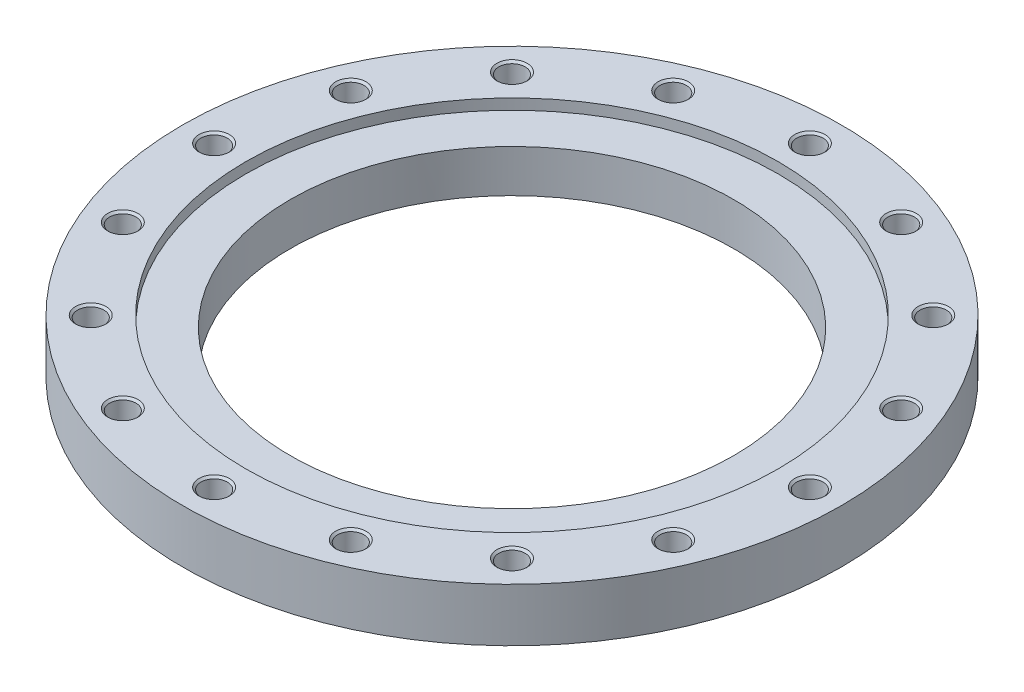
ISO-10303-21;
HEADER;
FILE_DESCRIPTION(('STEP AP214'),'2;1');
FILE_NAME('part.step','',(''),(''),'','','');
FILE_SCHEMA(('AUTOMOTIVE_DESIGN { 1 0 10303 214 1 1 1 1 }'));
ENDSEC;
DATA;
#1=APPLICATION_CONTEXT('core data for automotive mechanical design processes');
#2=APPLICATION_PROTOCOL_DEFINITION('international standard','automotive_design',2000,#1);
#3=PRODUCT_CONTEXT('',#1,'mechanical');
#4=PRODUCT('Part','Part','',(#3));
#5=PRODUCT_RELATED_PRODUCT_CATEGORY('part','',(#4));
#6=PRODUCT_DEFINITION_FORMATION('','',#4);
#7=PRODUCT_DEFINITION_CONTEXT('part definition',#1,'design');
#8=PRODUCT_DEFINITION('design','',#6,#7);
#9=PRODUCT_DEFINITION_SHAPE('','',#8);
#10=(LENGTH_UNIT() NAMED_UNIT(*) SI_UNIT(.MILLI.,.METRE.));
#11=(NAMED_UNIT(*) PLANE_ANGLE_UNIT() SI_UNIT($,.RADIAN.));
#12=(NAMED_UNIT(*) SI_UNIT($,.STERADIAN.) SOLID_ANGLE_UNIT());
#13=UNCERTAINTY_MEASURE_WITH_UNIT(LENGTH_MEASURE(1.E-05),#10,'distance_accuracy_value','');
#14=(GEOMETRIC_REPRESENTATION_CONTEXT(3) GLOBAL_UNCERTAINTY_ASSIGNED_CONTEXT((#13)) GLOBAL_UNIT_ASSIGNED_CONTEXT((#10,
#11,#12)) REPRESENTATION_CONTEXT('',''));
#15=CARTESIAN_POINT('',(0.,0.,0.));
#16=DIRECTION('',(0.,0.,1.));
#17=DIRECTION('',(1.,0.,0.));
#18=AXIS2_PLACEMENT_3D('',#15,#16,#17);
#19=CARTESIAN_POINT('',(0.,21.,0.));
#20=DIRECTION('',(0.,-1.,0.));
#21=DIRECTION('',(1.,0.,0.));
#22=AXIS2_PLACEMENT_3D('',#19,#20,#21);
#23=CYLINDRICAL_SURFACE('',#22,260.);
#24=CARTESIAN_POINT('',(0.,0.,0.));
#25=DIRECTION('',(0.,1.,0.));
#26=DIRECTION('',(1.,0.,0.));
#27=AXIS2_PLACEMENT_3D('',#24,#25,#26);
#28=CIRCLE('',#27,260.);
#29=CARTESIAN_POINT('',(260.,0.,0.));
#30=VERTEX_POINT('',#29);
#31=EDGE_CURVE('E9',#30,#30,#28,.T.);
#32=ORIENTED_EDGE('',*,*,#31,.T.);
#33=EDGE_LOOP('',(#32));
#34=FACE_BOUND('',#33,.T.);
#35=CARTESIAN_POINT('',(0.,42.,0.));
#36=DIRECTION('',(0.,1.,0.));
#37=DIRECTION('',(1.,0.,0.));
#38=AXIS2_PLACEMENT_3D('',#35,#36,#37);
#39=CIRCLE('',#38,260.);
#40=CARTESIAN_POINT('',(260.,42.,0.));
#41=VERTEX_POINT('',#40);
#42=EDGE_CURVE('E19',#41,#41,#39,.T.);
#43=ORIENTED_EDGE('',*,*,#42,.F.);
#44=EDGE_LOOP('',(#43));
#45=FACE_BOUND('',#44,.T.);
#46=ADVANCED_FACE('F15',(#34,#45),#23,.T.);
#47=CARTESIAN_POINT('',(217.5,0.,0.));
#48=DIRECTION('',(0.,-1.,0.));
#49=DIRECTION('',(-1.,0.,0.));
#50=AXIS2_PLACEMENT_3D('',#47,#48,#49);
#51=PLANE('',#50);
#52=CARTESIAN_POINT('',(0.,0.,0.));
#53=DIRECTION('',(0.,1.,0.));
#54=DIRECTION('',(1.,0.,0.));
#55=AXIS2_PLACEMENT_3D('',#52,#53,#54);
#56=CIRCLE('',#55,175.);
#57=CARTESIAN_POINT('',(175.,0.,0.));
#58=VERTEX_POINT('',#57);
#59=EDGE_CURVE('E25',#58,#58,#56,.T.);
#60=ORIENTED_EDGE('',*,*,#59,.T.);
#61=EDGE_LOOP('',(#60));
#62=FACE_BOUND('',#61,.T.);
#63=ORIENTED_EDGE('',*,*,#31,.F.);
#64=EDGE_LOOP('',(#63));
#65=FACE_BOUND('',#64,.T.);
#66=ADVANCED_FACE('F601',(#62,#65),#51,.T.);
#67=CARTESIAN_POINT('',(0.,21.,0.));
#68=DIRECTION('',(0.,-1.,0.));
#69=DIRECTION('',(1.,0.,0.));
#70=AXIS2_PLACEMENT_3D('',#67,#68,#69);
#71=CYLINDRICAL_SURFACE('',#70,175.);
#72=ORIENTED_EDGE('',*,*,#59,.F.);
#73=EDGE_LOOP('',(#72));
#74=FACE_BOUND('',#73,.T.);
#75=CARTESIAN_POINT('',(0.,33.6,0.));
#76=DIRECTION('',(0.,1.,0.));
#77=DIRECTION('',(1.,0.,0.));
#78=AXIS2_PLACEMENT_3D('',#75,#76,#77);
#79=CIRCLE('',#78,175.);
#80=CARTESIAN_POINT('',(-175.,33.6,0.));
#81=VERTEX_POINT('',#80);
#82=EDGE_CURVE('E402',#81,#81,#79,.T.);
#83=ORIENTED_EDGE('',*,*,#82,.T.);
#84=EDGE_LOOP('',(#83));
#85=FACE_BOUND('',#84,.T.);
#86=ADVANCED_FACE('F606',(#74,#85),#71,.F.);
#87=CARTESIAN_POINT('',(217.5,42.,0.));
#88=DIRECTION('',(0.,1.,0.));
#89=DIRECTION('',(1.,0.,0.));
#90=AXIS2_PLACEMENT_3D('',#87,#88,#89);
#91=PLANE('',#90);
#92=ORIENTED_EDGE('',*,*,#42,.T.);
#93=EDGE_LOOP('',(#92));
#94=FACE_BOUND('',#93,.T.);
#95=CARTESIAN_POINT('',(0.,42.,0.));
#96=DIRECTION('',(0.,-1.,0.));
#97=DIRECTION('',(1.,0.,0.));
#98=AXIS2_PLACEMENT_3D('',#95,#96,#97);
#99=CIRCLE('',#98,210.);
#100=CARTESIAN_POINT('',(-210.,42.,0.));
#101=VERTEX_POINT('',#100);
#102=EDGE_CURVE('E398',#101,#101,#99,.T.);
#103=ORIENTED_EDGE('',*,*,#102,.T.);
#104=EDGE_LOOP('',(#103));
#105=FACE_BOUND('',#104,.T.);
#106=CARTESIAN_POINT('',(235.,42.,0.));
#107=DIRECTION('',(0.,-1.,0.));
#108=DIRECTION('',(1.,0.,0.));
#109=AXIS2_PLACEMENT_3D('',#106,#107,#108);
#110=CIRCLE('',#109,12.);
#111=CARTESIAN_POINT('',(247.,42.,0.));
#112=VERTEX_POINT('',#111);
#113=EDGE_CURVE('E394',#112,#112,#110,.T.);
#114=ORIENTED_EDGE('',*,*,#113,.T.);
#115=EDGE_LOOP('',(#114));
#116=FACE_BOUND('',#115,.T.);
#117=CARTESIAN_POINT('',(217.111690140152,42.,-89.9306066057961));
#118=DIRECTION('',(0.,-1.,0.));
#119=DIRECTION('',(0.923879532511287,0.,-0.38268343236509));
#120=AXIS2_PLACEMENT_3D('',#117,#118,#119);
#121=CIRCLE('',#120,12.);
#122=CARTESIAN_POINT('',(228.198244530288,42.,-94.5228077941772));
#123=VERTEX_POINT('',#122);
#124=EDGE_CURVE('E384',#123,#123,#121,.T.);
#125=ORIENTED_EDGE('',*,*,#124,.T.);
#126=EDGE_LOOP('',(#125));
#127=FACE_BOUND('',#126,.T.);
#128=CARTESIAN_POINT('',(166.170093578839,42.,-166.170093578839));
#129=DIRECTION('',(0.,-1.,0.));
#130=DIRECTION('',(0.707106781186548,0.,-0.707106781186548));
#131=AXIS2_PLACEMENT_3D('',#128,#129,#130);
#132=CIRCLE('',#131,12.);
#133=CARTESIAN_POINT('',(174.655374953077,42.,-174.655374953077));
#134=VERTEX_POINT('',#133);
#135=EDGE_CURVE('E370',#134,#134,#132,.T.);
#136=ORIENTED_EDGE('',*,*,#135,.T.);
#137=EDGE_LOOP('',(#136));
#138=FACE_BOUND('',#137,.T.);
#139=CARTESIAN_POINT('',(89.9306066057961,42.,-217.111690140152));
#140=DIRECTION('',(0.,-1.,0.));
#141=DIRECTION('',(0.38268343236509,0.,-0.923879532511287));
#142=AXIS2_PLACEMENT_3D('',#139,#140,#141);
#143=CIRCLE('',#142,12.);
#144=CARTESIAN_POINT('',(94.5228077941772,42.,-228.198244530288));
#145=VERTEX_POINT('',#144);
#146=EDGE_CURVE('E473',#145,#145,#143,.T.);
#147=ORIENTED_EDGE('',*,*,#146,.T.);
#148=EDGE_LOOP('',(#147));
#149=FACE_BOUND('',#148,.T.);
#150=CARTESIAN_POINT('',(0.,42.,-235.));
#151=DIRECTION('',(0.,-1.,0.));
#152=DIRECTION('',(0.,0.,-1.));
#153=AXIS2_PLACEMENT_3D('',#150,#151,#152);
#154=CIRCLE('',#153,12.);
#155=CARTESIAN_POINT('',(0.,42.,-247.));
#156=VERTEX_POINT('',#155);
#157=EDGE_CURVE('E415',#156,#156,#154,.T.);
#158=ORIENTED_EDGE('',*,*,#157,.T.);
#159=EDGE_LOOP('',(#158));
#160=FACE_BOUND('',#159,.T.);
#161=CARTESIAN_POINT('',(-89.9306066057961,42.,-217.111690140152));
#162=DIRECTION('',(0.,-1.,0.));
#163=DIRECTION('',(-0.38268343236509,0.,-0.923879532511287));
#164=AXIS2_PLACEMENT_3D('',#161,#162,#163);
#165=CIRCLE('',#164,12.);
#166=CARTESIAN_POINT('',(-94.5228077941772,42.,-228.198244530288));
#167=VERTEX_POINT('',#166);
#168=EDGE_CURVE('E550',#167,#167,#165,.T.);
#169=ORIENTED_EDGE('',*,*,#168,.T.);
#170=EDGE_LOOP('',(#169));
#171=FACE_BOUND('',#170,.T.);
#172=CARTESIAN_POINT('',(-166.170093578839,42.,-166.170093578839));
#173=DIRECTION('',(0.,-1.,0.));
#174=DIRECTION('',(-0.707106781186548,0.,-0.707106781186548));
#175=AXIS2_PLACEMENT_3D('',#172,#173,#174);
#176=CIRCLE('',#175,12.);
#177=CARTESIAN_POINT('',(-174.655374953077,42.,-174.655374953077));
#178=VERTEX_POINT('',#177);
#179=EDGE_CURVE('E543',#178,#178,#176,.T.);
#180=ORIENTED_EDGE('',*,*,#179,.T.);
#181=EDGE_LOOP('',(#180));
#182=FACE_BOUND('',#181,.T.);
#183=CARTESIAN_POINT('',(-217.111690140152,42.,-89.9306066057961));
#184=DIRECTION('',(0.,-1.,0.));
#185=DIRECTION('',(-0.923879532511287,0.,-0.38268343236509));
#186=AXIS2_PLACEMENT_3D('',#183,#184,#185);
#187=CIRCLE('',#186,12.);
#188=CARTESIAN_POINT('',(-228.198244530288,42.,-94.5228077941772));
#189=VERTEX_POINT('',#188);
#190=EDGE_CURVE('E419',#189,#189,#187,.T.);
#191=ORIENTED_EDGE('',*,*,#190,.T.);
#192=EDGE_LOOP('',(#191));
#193=FACE_BOUND('',#192,.T.);
#194=CARTESIAN_POINT('',(-235.,42.,0.));
#195=DIRECTION('',(0.,-1.,0.));
#196=DIRECTION('',(-1.,0.,0.));
#197=AXIS2_PLACEMENT_3D('',#194,#195,#196);
#198=CIRCLE('',#197,12.);
#199=CARTESIAN_POINT('',(-247.,42.,0.));
#200=VERTEX_POINT('',#199);
#201=EDGE_CURVE('E525',#200,#200,#198,.T.);
#202=ORIENTED_EDGE('',*,*,#201,.T.);
#203=EDGE_LOOP('',(#202));
#204=FACE_BOUND('',#203,.T.);
#205=CARTESIAN_POINT('',(-217.111690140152,42.,89.9306066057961));
#206=DIRECTION('',(0.,-1.,0.));
#207=DIRECTION('',(-0.923879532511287,0.,0.38268343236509));
#208=AXIS2_PLACEMENT_3D('',#205,#206,#207);
#209=CIRCLE('',#208,12.);
#210=CARTESIAN_POINT('',(-228.198244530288,42.,94.5228077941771));
#211=VERTEX_POINT('',#210);
#212=EDGE_CURVE('E479',#211,#211,#209,.T.);
#213=ORIENTED_EDGE('',*,*,#212,.T.);
#214=EDGE_LOOP('',(#213));
#215=FACE_BOUND('',#214,.T.);
#216=CARTESIAN_POINT('',(-166.170093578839,42.,166.170093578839));
#217=DIRECTION('',(0.,-1.,0.));
#218=DIRECTION('',(-0.707106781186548,0.,0.707106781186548));
#219=AXIS2_PLACEMENT_3D('',#216,#217,#218);
#220=CIRCLE('',#219,12.);
#221=CARTESIAN_POINT('',(-174.655374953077,42.,174.655374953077));
#222=VERTEX_POINT('',#221);
#223=EDGE_CURVE('E502',#222,#222,#220,.T.);
#224=ORIENTED_EDGE('',*,*,#223,.T.);
#225=EDGE_LOOP('',(#224));
#226=FACE_BOUND('',#225,.T.);
#227=CARTESIAN_POINT('',(-89.9306066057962,42.,217.111690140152));
#228=DIRECTION('',(0.,-1.,0.));
#229=DIRECTION('',(-0.382683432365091,0.,0.923879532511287));
#230=AXIS2_PLACEMENT_3D('',#227,#228,#229);
#231=CIRCLE('',#230,12.);
#232=CARTESIAN_POINT('',(-94.5228077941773,42.,228.198244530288));
#233=VERTEX_POINT('',#232);
#234=EDGE_CURVE('E487',#233,#233,#231,.T.);
#235=ORIENTED_EDGE('',*,*,#234,.T.);
#236=EDGE_LOOP('',(#235));
#237=FACE_BOUND('',#236,.T.);
#238=CARTESIAN_POINT('',(0.,42.,235.));
#239=DIRECTION('',(0.,-1.,0.));
#240=DIRECTION('',(0.,0.,1.));
#241=AXIS2_PLACEMENT_3D('',#238,#239,#240);
#242=CIRCLE('',#241,12.);
#243=CARTESIAN_POINT('',(0.,42.,247.));
#244=VERTEX_POINT('',#243);
#245=EDGE_CURVE('E467',#244,#244,#242,.T.);
#246=ORIENTED_EDGE('',*,*,#245,.T.);
#247=EDGE_LOOP('',(#246));
#248=FACE_BOUND('',#247,.T.);
#249=CARTESIAN_POINT('',(89.9306066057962,42.,217.111690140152));
#250=DIRECTION('',(0.,-1.,0.));
#251=DIRECTION('',(0.38268343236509,0.,0.923879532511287));
#252=AXIS2_PLACEMENT_3D('',#249,#250,#251);
#253=CIRCLE('',#252,12.);
#254=CARTESIAN_POINT('',(94.5228077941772,42.,228.198244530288));
#255=VERTEX_POINT('',#254);
#256=EDGE_CURVE('E435',#255,#255,#253,.T.);
#257=ORIENTED_EDGE('',*,*,#256,.T.);
#258=EDGE_LOOP('',(#257));
#259=FACE_BOUND('',#258,.T.);
#260=CARTESIAN_POINT('',(166.170093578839,42.,166.170093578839));
#261=DIRECTION('',(0.,-1.,0.));
#262=DIRECTION('',(0.707106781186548,0.,0.707106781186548));
#263=AXIS2_PLACEMENT_3D('',#260,#261,#262);
#264=CIRCLE('',#263,12.);
#265=CARTESIAN_POINT('',(174.655374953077,42.,174.655374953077));
#266=VERTEX_POINT('',#265);
#267=EDGE_CURVE('E440',#266,#266,#264,.T.);
#268=ORIENTED_EDGE('',*,*,#267,.T.);
#269=EDGE_LOOP('',(#268));
#270=FACE_BOUND('',#269,.T.);
#271=CARTESIAN_POINT('',(217.111690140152,42.,89.9306066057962));
#272=DIRECTION('',(0.,-1.,0.));
#273=DIRECTION('',(0.923879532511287,0.,0.382683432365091));
#274=AXIS2_PLACEMENT_3D('',#271,#272,#273);
#275=CIRCLE('',#274,12.);
#276=CARTESIAN_POINT('',(228.198244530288,42.,94.5228077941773));
#277=VERTEX_POINT('',#276);
#278=EDGE_CURVE('E411',#277,#277,#275,.T.);
#279=ORIENTED_EDGE('',*,*,#278,.T.);
#280=EDGE_LOOP('',(#279));
#281=FACE_BOUND('',#280,.T.);
#282=ADVANCED_FACE('F17',(#94,#105,#116,#127,#138,#149,#160,#171,#182,#193,#204,#215,#226,#237,
#248,#259,#270,#281),#91,.T.);
#283=CARTESIAN_POINT('',(0.,33.6,0.));
#284=DIRECTION('',(0.,-1.,0.));
#285=DIRECTION('',(-1.,0.,0.));
#286=AXIS2_PLACEMENT_3D('',#283,#284,#285);
#287=PLANE('',#286);
#288=CARTESIAN_POINT('',(0.,33.6,0.));
#289=DIRECTION('',(0.,-1.,0.));
#290=DIRECTION('',(1.,0.,0.));
#291=AXIS2_PLACEMENT_3D('',#288,#289,#290);
#292=CIRCLE('',#291,210.);
#293=CARTESIAN_POINT('',(210.,33.6,0.));
#294=VERTEX_POINT('',#293);
#295=EDGE_CURVE('E375',#294,#294,#292,.T.);
#296=ORIENTED_EDGE('',*,*,#295,.F.);
#297=EDGE_LOOP('',(#296));
#298=FACE_BOUND('',#297,.T.);
#299=ORIENTED_EDGE('',*,*,#82,.F.);
#300=EDGE_LOOP('',(#299));
#301=FACE_BOUND('',#300,.T.);
#302=ADVANCED_FACE('F760',(#298,#301),#287,.F.);
#303=CARTESIAN_POINT('',(0.,39.9,0.));
#304=DIRECTION('',(0.,-1.,0.));
#305=DIRECTION('',(1.,0.,0.));
#306=AXIS2_PLACEMENT_3D('',#303,#304,#305);
#307=CYLINDRICAL_SURFACE('',#306,210.);
#308=ORIENTED_EDGE('',*,*,#295,.T.);
#309=EDGE_LOOP('',(#308));
#310=FACE_BOUND('',#309,.T.);
#311=ORIENTED_EDGE('',*,*,#102,.F.);
#312=EDGE_LOOP('',(#311));
#313=FACE_BOUND('',#312,.T.);
#314=ADVANCED_FACE('F763',(#310,#313),#307,.F.);
#315=CARTESIAN_POINT('',(235.,6.00463463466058,0.));
#316=DIRECTION('',(0.,1.,0.));
#317=DIRECTION('',(1.,0.,0.));
#318=AXIS2_PLACEMENT_3D('',#315,#316,#317);
#319=CONICAL_SURFACE('',#318,5.188125,1.0471975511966);
#320=CARTESIAN_POINT('',(235.,9.,0.));
#321=DIRECTION('',(0.,-1.,0.));
#322=DIRECTION('',(1.,0.,0.));
#323=AXIS2_PLACEMENT_3D('',#320,#321,#322);
#324=CIRCLE('',#323,10.37625);
#325=CARTESIAN_POINT('',(245.37625,9.,0.));
#326=VERTEX_POINT('',#325);
#327=EDGE_CURVE('E63',#326,#326,#324,.T.);
#328=ORIENTED_EDGE('',*,*,#327,.F.);
#329=EDGE_LOOP('',(#328));
#330=FACE_BOUND('',#329,.T.);
#331=CARTESIAN_POINT('',(235.,3.00926926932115,0.));
#332=VERTEX_POINT('',#331);
#333=VERTEX_LOOP('',#332);
#334=FACE_BOUND('',#333,.T.);
#335=ADVANCED_FACE('F834',(#330,#334),#319,.F.);
#336=CARTESIAN_POINT('',(235.,12.688125,0.));
#337=DIRECTION('',(0.,1.,0.));
#338=DIRECTION('',(1.,0.,0.));
#339=AXIS2_PLACEMENT_3D('',#336,#337,#338);
#340=CYLINDRICAL_SURFACE('',#339,10.37625);
#341=CARTESIAN_POINT('',(235.,16.37625,0.));
#342=DIRECTION('',(0.,-1.,0.));
#343=DIRECTION('',(1.,0.,0.));
#344=AXIS2_PLACEMENT_3D('',#341,#342,#343);
#345=CIRCLE('',#344,10.37625);
#346=CARTESIAN_POINT('',(245.37625,16.37625,0.));
#347=VERTEX_POINT('',#346);
#348=EDGE_CURVE('E71',#347,#347,#345,.T.);
#349=ORIENTED_EDGE('',*,*,#348,.F.);
#350=EDGE_LOOP('',(#349));
#351=FACE_BOUND('',#350,.T.);
#352=ORIENTED_EDGE('',*,*,#327,.T.);
#353=EDGE_LOOP('',(#352));
#354=FACE_BOUND('',#353,.T.);
#355=ADVANCED_FACE('F836',(#351,#354),#340,.F.);
#356=CARTESIAN_POINT('',(235.,17.188125,0.));
#357=DIRECTION('',(0.,1.,0.));
#358=DIRECTION('',(1.,0.,0.));
#359=AXIS2_PLACEMENT_3D('',#356,#357,#358);
#360=CONICAL_SURFACE('',#359,11.188125,0.785398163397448);
#361=CARTESIAN_POINT('',(235.,18.,0.));
#362=DIRECTION('',(0.,-1.,0.));
#363=DIRECTION('',(1.,0.,0.));
#364=AXIS2_PLACEMENT_3D('',#361,#362,#363);
#365=CIRCLE('',#364,12.);
#366=CARTESIAN_POINT('',(247.,18.,0.));
#367=VERTEX_POINT('',#366);
#368=EDGE_CURVE('E397',#367,#367,#365,.T.);
#369=ORIENTED_EDGE('',*,*,#368,.F.);
#370=EDGE_LOOP('',(#369));
#371=FACE_BOUND('',#370,.T.);
#372=ORIENTED_EDGE('',*,*,#348,.T.);
#373=EDGE_LOOP('',(#372));
#374=FACE_BOUND('',#373,.T.);
#375=ADVANCED_FACE('F842',(#371,#374),#360,.F.);
#376=CARTESIAN_POINT('',(246.188125,18.,0.));
#377=DIRECTION('',(0.,1.,0.));
#378=DIRECTION('',(-1.,0.,0.));
#379=AXIS2_PLACEMENT_3D('',#376,#377,#378);
#380=PLANE('',#379);
#381=CARTESIAN_POINT('',(235.,18.,0.));
#382=DIRECTION('',(0.,-1.,0.));
#383=DIRECTION('',(1.,0.,0.));
#384=AXIS2_PLACEMENT_3D('',#381,#382,#383);
#385=CIRCLE('',#384,10.37625);
#386=CARTESIAN_POINT('',(245.37625,18.,0.));
#387=VERTEX_POINT('',#386);
#388=EDGE_CURVE('E396',#387,#387,#385,.T.);
#389=ORIENTED_EDGE('',*,*,#388,.F.);
#390=EDGE_LOOP('',(#389));
#391=FACE_BOUND('',#390,.T.);
#392=ORIENTED_EDGE('',*,*,#368,.T.);
#393=EDGE_LOOP('',(#392));
#394=FACE_BOUND('',#393,.T.);
#395=ADVANCED_FACE('F853',(#391,#394),#380,.F.);
#396=CARTESIAN_POINT('',(235.,29.188125,0.));
#397=DIRECTION('',(0.,1.,0.));
#398=DIRECTION('',(1.,0.,0.));
#399=AXIS2_PLACEMENT_3D('',#396,#397,#398);
#400=CYLINDRICAL_SURFACE('',#399,10.37625);
#401=CARTESIAN_POINT('',(235.,40.37625,0.));
#402=DIRECTION('',(0.,-1.,0.));
#403=DIRECTION('',(1.,0.,0.));
#404=AXIS2_PLACEMENT_3D('',#401,#402,#403);
#405=CIRCLE('',#404,10.37625);
#406=CARTESIAN_POINT('',(245.37625,40.37625,0.));
#407=VERTEX_POINT('',#406);
#408=EDGE_CURVE('E392',#407,#407,#405,.T.);
#409=ORIENTED_EDGE('',*,*,#408,.F.);
#410=EDGE_LOOP('',(#409));
#411=FACE_BOUND('',#410,.T.);
#412=ORIENTED_EDGE('',*,*,#388,.T.);
#413=EDGE_LOOP('',(#412));
#414=FACE_BOUND('',#413,.T.);
#415=ADVANCED_FACE('F857',(#411,#414),#400,.F.);
#416=CARTESIAN_POINT('',(235.,41.188125,0.));
#417=DIRECTION('',(0.,1.,0.));
#418=DIRECTION('',(1.,0.,0.));
#419=AXIS2_PLACEMENT_3D('',#416,#417,#418);
#420=CONICAL_SURFACE('',#419,11.188125,0.785398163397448);
#421=ORIENTED_EDGE('',*,*,#113,.F.);
#422=EDGE_LOOP('',(#421));
#423=FACE_BOUND('',#422,.T.);
#424=ORIENTED_EDGE('',*,*,#408,.T.);
#425=EDGE_LOOP('',(#424));
#426=FACE_BOUND('',#425,.T.);
#427=ADVANCED_FACE('F861',(#423,#426),#420,.F.);
#428=CARTESIAN_POINT('',(217.111690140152,6.00463463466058,-89.9306066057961));
#429=DIRECTION('',(0.,1.,0.));
#430=DIRECTION('',(0.923879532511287,0.,-0.38268343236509));
#431=AXIS2_PLACEMENT_3D('',#428,#429,#430);
#432=CONICAL_SURFACE('',#431,5.188125,1.0471975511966);
#433=CARTESIAN_POINT('',(217.111690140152,9.,-89.9306066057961));
#434=DIRECTION('',(0.,-1.,0.));
#435=DIRECTION('',(0.923879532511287,0.,-0.38268343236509));
#436=AXIS2_PLACEMENT_3D('',#433,#434,#435);
#437=CIRCLE('',#436,10.37625);
#438=CARTESIAN_POINT('',(226.698095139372,9.,-93.9014255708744));
#439=VERTEX_POINT('',#438);
#440=EDGE_CURVE('E391',#439,#439,#437,.T.);
#441=ORIENTED_EDGE('',*,*,#440,.F.);
#442=EDGE_LOOP('',(#441));
#443=FACE_BOUND('',#442,.T.);
#444=CARTESIAN_POINT('',(217.111690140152,3.00926926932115,-89.9306066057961));
#445=VERTEX_POINT('',#444);
#446=VERTEX_LOOP('',#445);
#447=FACE_BOUND('',#446,.T.);
#448=ADVANCED_FACE('F865',(#443,#447),#432,.F.);
#449=CARTESIAN_POINT('',(217.111690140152,12.688125,-89.9306066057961));
#450=DIRECTION('',(0.,1.,0.));
#451=DIRECTION('',(0.923879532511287,0.,-0.38268343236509));
#452=AXIS2_PLACEMENT_3D('',#449,#450,#451);
#453=CYLINDRICAL_SURFACE('',#452,10.37625);
#454=CARTESIAN_POINT('',(217.111690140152,16.37625,-89.9306066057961));
#455=DIRECTION('',(0.,-1.,0.));
#456=DIRECTION('',(0.923879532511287,0.,-0.38268343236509));
#457=AXIS2_PLACEMENT_3D('',#454,#455,#456);
#458=CIRCLE('',#457,10.37625);
#459=CARTESIAN_POINT('',(226.698095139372,16.37625,-93.9014255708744));
#460=VERTEX_POINT('',#459);
#461=EDGE_CURVE('E389',#460,#460,#458,.T.);
#462=ORIENTED_EDGE('',*,*,#461,.F.);
#463=EDGE_LOOP('',(#462));
#464=FACE_BOUND('',#463,.T.);
#465=ORIENTED_EDGE('',*,*,#440,.T.);
#466=EDGE_LOOP('',(#465));
#467=FACE_BOUND('',#466,.T.);
#468=ADVANCED_FACE('F869',(#464,#467),#453,.F.);
#469=CARTESIAN_POINT('',(217.111690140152,17.188125,-89.9306066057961));
#470=DIRECTION('',(0.,1.,0.));
#471=DIRECTION('',(0.923879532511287,0.,-0.38268343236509));
#472=AXIS2_PLACEMENT_3D('',#469,#470,#471);
#473=CONICAL_SURFACE('',#472,11.188125,0.785398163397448);
#474=CARTESIAN_POINT('',(217.111690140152,18.,-89.9306066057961));
#475=DIRECTION('',(0.,-1.,0.));
#476=DIRECTION('',(0.923879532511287,0.,-0.38268343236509));
#477=AXIS2_PLACEMENT_3D('',#474,#475,#476);
#478=CIRCLE('',#477,12.);
#479=CARTESIAN_POINT('',(228.198244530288,18.,-94.5228077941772));
#480=VERTEX_POINT('',#479);
#481=EDGE_CURVE('E387',#480,#480,#478,.T.);
#482=ORIENTED_EDGE('',*,*,#481,.F.);
#483=EDGE_LOOP('',(#482));
#484=FACE_BOUND('',#483,.T.);
#485=ORIENTED_EDGE('',*,*,#461,.T.);
#486=EDGE_LOOP('',(#485));
#487=FACE_BOUND('',#486,.T.);
#488=ADVANCED_FACE('F816',(#484,#487),#473,.F.);
#489=CARTESIAN_POINT('',(227.448169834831,18.,-94.2121166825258));
#490=DIRECTION('',(0.,1.,0.));
#491=DIRECTION('',(-0.923879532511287,0.,0.38268343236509));
#492=AXIS2_PLACEMENT_3D('',#489,#490,#491);
#493=PLANE('',#492);
#494=CARTESIAN_POINT('',(217.111690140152,18.,-89.9306066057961));
#495=DIRECTION('',(0.,-1.,0.));
#496=DIRECTION('',(0.923879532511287,0.,-0.38268343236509));
#497=AXIS2_PLACEMENT_3D('',#494,#495,#496);
#498=CIRCLE('',#497,10.37625);
#499=CARTESIAN_POINT('',(226.698095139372,18.,-93.9014255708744));
#500=VERTEX_POINT('',#499);
#501=EDGE_CURVE('E385',#500,#500,#498,.T.);
#502=ORIENTED_EDGE('',*,*,#501,.F.);
#503=EDGE_LOOP('',(#502));
#504=FACE_BOUND('',#503,.T.);
#505=ORIENTED_EDGE('',*,*,#481,.T.);
#506=EDGE_LOOP('',(#505));
#507=FACE_BOUND('',#506,.T.);
#508=ADVANCED_FACE('F812',(#504,#507),#493,.F.);
#509=CARTESIAN_POINT('',(217.111690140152,29.188125,-89.9306066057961));
#510=DIRECTION('',(0.,1.,0.));
#511=DIRECTION('',(0.923879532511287,0.,-0.38268343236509));
#512=AXIS2_PLACEMENT_3D('',#509,#510,#511);
#513=CYLINDRICAL_SURFACE('',#512,10.37625);
#514=CARTESIAN_POINT('',(217.111690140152,40.37625,-89.9306066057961));
#515=DIRECTION('',(0.,-1.,0.));
#516=DIRECTION('',(0.923879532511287,0.,-0.38268343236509));
#517=AXIS2_PLACEMENT_3D('',#514,#515,#516);
#518=CIRCLE('',#517,10.37625);
#519=CARTESIAN_POINT('',(226.698095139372,40.37625,-93.9014255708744));
#520=VERTEX_POINT('',#519);
#521=EDGE_CURVE('E382',#520,#520,#518,.T.);
#522=ORIENTED_EDGE('',*,*,#521,.F.);
#523=EDGE_LOOP('',(#522));
#524=FACE_BOUND('',#523,.T.);
#525=ORIENTED_EDGE('',*,*,#501,.T.);
#526=EDGE_LOOP('',(#525));
#527=FACE_BOUND('',#526,.T.);
#528=ADVANCED_FACE('F815',(#524,#527),#513,.F.);
#529=CARTESIAN_POINT('',(217.111690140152,41.188125,-89.9306066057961));
#530=DIRECTION('',(0.,1.,0.));
#531=DIRECTION('',(0.923879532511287,0.,-0.38268343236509));
#532=AXIS2_PLACEMENT_3D('',#529,#530,#531);
#533=CONICAL_SURFACE('',#532,11.188125,0.785398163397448);
#534=ORIENTED_EDGE('',*,*,#124,.F.);
#535=EDGE_LOOP('',(#534));
#536=FACE_BOUND('',#535,.T.);
#537=ORIENTED_EDGE('',*,*,#521,.T.);
#538=EDGE_LOOP('',(#537));
#539=FACE_BOUND('',#538,.T.);
#540=ADVANCED_FACE('F879',(#536,#539),#533,.F.);
#541=CARTESIAN_POINT('',(166.170093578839,6.00463463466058,-166.170093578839));
#542=DIRECTION('',(0.,1.,0.));
#543=DIRECTION('',(0.707106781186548,0.,-0.707106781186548));
#544=AXIS2_PLACEMENT_3D('',#541,#542,#543);
#545=CONICAL_SURFACE('',#544,5.188125,1.0471975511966);
#546=CARTESIAN_POINT('',(166.170093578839,9.,-166.170093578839));
#547=DIRECTION('',(0.,-1.,0.));
#548=DIRECTION('',(0.707106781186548,0.,-0.707106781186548));
#549=AXIS2_PLACEMENT_3D('',#546,#547,#548);
#550=CIRCLE('',#549,10.37625);
#551=CARTESIAN_POINT('',(173.507210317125,9.,-173.507210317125));
#552=VERTEX_POINT('',#551);
#553=EDGE_CURVE('E93',#552,#552,#550,.T.);
#554=ORIENTED_EDGE('',*,*,#553,.F.);
#555=EDGE_LOOP('',(#554));
#556=FACE_BOUND('',#555,.T.);
#557=CARTESIAN_POINT('',(166.170093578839,3.00926926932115,-166.170093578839));
#558=VERTEX_POINT('',#557);
#559=VERTEX_LOOP('',#558);
#560=FACE_BOUND('',#559,.T.);
#561=ADVANCED_FACE('F784',(#556,#560),#545,.F.);
#562=CARTESIAN_POINT('',(166.170093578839,12.688125,-166.170093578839));
#563=DIRECTION('',(0.,1.,0.));
#564=DIRECTION('',(0.707106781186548,0.,-0.707106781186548));
#565=AXIS2_PLACEMENT_3D('',#562,#563,#564);
#566=CYLINDRICAL_SURFACE('',#565,10.37625);
#567=CARTESIAN_POINT('',(166.170093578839,16.37625,-166.170093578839));
#568=DIRECTION('',(0.,-1.,0.));
#569=DIRECTION('',(0.707106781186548,0.,-0.707106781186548));
#570=AXIS2_PLACEMENT_3D('',#567,#568,#569);
#571=CIRCLE('',#570,10.37625);
#572=CARTESIAN_POINT('',(173.507210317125,16.37625,-173.507210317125));
#573=VERTEX_POINT('',#572);
#574=EDGE_CURVE('E88',#573,#573,#571,.T.);
#575=ORIENTED_EDGE('',*,*,#574,.F.);
#576=EDGE_LOOP('',(#575));
#577=FACE_BOUND('',#576,.T.);
#578=ORIENTED_EDGE('',*,*,#553,.T.);
#579=EDGE_LOOP('',(#578));
#580=FACE_BOUND('',#579,.T.);
#581=ADVANCED_FACE('F780',(#577,#580),#566,.F.);
#582=CARTESIAN_POINT('',(166.170093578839,17.188125,-166.170093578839));
#583=DIRECTION('',(0.,1.,0.));
#584=DIRECTION('',(0.707106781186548,0.,-0.707106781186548));
#585=AXIS2_PLACEMENT_3D('',#582,#583,#584);
#586=CONICAL_SURFACE('',#585,11.188125,0.785398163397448);
#587=CARTESIAN_POINT('',(166.170093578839,18.,-166.170093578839));
#588=DIRECTION('',(0.,-1.,0.));
#589=DIRECTION('',(0.707106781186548,0.,-0.707106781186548));
#590=AXIS2_PLACEMENT_3D('',#587,#588,#589);
#591=CIRCLE('',#590,12.);
#592=CARTESIAN_POINT('',(174.655374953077,18.,-174.655374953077));
#593=VERTEX_POINT('',#592);
#594=EDGE_CURVE('E380',#593,#593,#591,.T.);
#595=ORIENTED_EDGE('',*,*,#594,.F.);
#596=EDGE_LOOP('',(#595));
#597=FACE_BOUND('',#596,.T.);
#598=ORIENTED_EDGE('',*,*,#574,.T.);
#599=EDGE_LOOP('',(#598));
#600=FACE_BOUND('',#599,.T.);
#601=ADVANCED_FACE('F783',(#597,#600),#586,.F.);
#602=CARTESIAN_POINT('',(174.081292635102,18.,-174.081292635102));
#603=DIRECTION('',(0.,1.,0.));
#604=DIRECTION('',(-0.707106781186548,0.,0.707106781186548));
#605=AXIS2_PLACEMENT_3D('',#602,#603,#604);
#606=PLANE('',#605);
#607=CARTESIAN_POINT('',(166.170093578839,18.,-166.170093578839));
#608=DIRECTION('',(0.,-1.,0.));
#609=DIRECTION('',(0.707106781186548,0.,-0.707106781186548));
#610=AXIS2_PLACEMENT_3D('',#607,#608,#609);
#611=CIRCLE('',#610,10.37625);
#612=CARTESIAN_POINT('',(173.507210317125,18.,-173.507210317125));
#613=VERTEX_POINT('',#612);
#614=EDGE_CURVE('E378',#613,#613,#611,.T.);
#615=ORIENTED_EDGE('',*,*,#614,.F.);
#616=EDGE_LOOP('',(#615));
#617=FACE_BOUND('',#616,.T.);
#618=ORIENTED_EDGE('',*,*,#594,.T.);
#619=EDGE_LOOP('',(#618));
#620=FACE_BOUND('',#619,.T.);
#621=ADVANCED_FACE('F886',(#617,#620),#606,.F.);
#622=CARTESIAN_POINT('',(166.170093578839,29.188125,-166.170093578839));
#623=DIRECTION('',(0.,1.,0.));
#624=DIRECTION('',(0.707106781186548,0.,-0.707106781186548));
#625=AXIS2_PLACEMENT_3D('',#622,#623,#624);
#626=CYLINDRICAL_SURFACE('',#625,10.37625);
#627=CARTESIAN_POINT('',(166.170093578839,40.37625,-166.170093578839));
#628=DIRECTION('',(0.,-1.,0.));
#629=DIRECTION('',(0.707106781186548,0.,-0.707106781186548));
#630=AXIS2_PLACEMENT_3D('',#627,#628,#629);
#631=CIRCLE('',#630,10.37625);
#632=CARTESIAN_POINT('',(173.507210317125,40.37625,-173.507210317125));
#633=VERTEX_POINT('',#632);
#634=EDGE_CURVE('E368',#633,#633,#631,.T.);
#635=ORIENTED_EDGE('',*,*,#634,.F.);
#636=EDGE_LOOP('',(#635));
#637=FACE_BOUND('',#636,.T.);
#638=ORIENTED_EDGE('',*,*,#614,.T.);
#639=EDGE_LOOP('',(#638));
#640=FACE_BOUND('',#639,.T.);
#641=ADVANCED_FACE('F890',(#637,#640),#626,.F.);
#642=CARTESIAN_POINT('',(166.170093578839,41.188125,-166.170093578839));
#643=DIRECTION('',(0.,1.,0.));
#644=DIRECTION('',(0.707106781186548,0.,-0.707106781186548));
#645=AXIS2_PLACEMENT_3D('',#642,#643,#644);
#646=CONICAL_SURFACE('',#645,11.188125,0.785398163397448);
#647=ORIENTED_EDGE('',*,*,#135,.F.);
#648=EDGE_LOOP('',(#647));
#649=FACE_BOUND('',#648,.T.);
#650=ORIENTED_EDGE('',*,*,#634,.T.);
#651=EDGE_LOOP('',(#650));
#652=FACE_BOUND('',#651,.T.);
#653=ADVANCED_FACE('F894',(#649,#652),#646,.F.);
#654=CARTESIAN_POINT('',(89.9306066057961,6.00463463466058,-217.111690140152));
#655=DIRECTION('',(0.,1.,0.));
#656=DIRECTION('',(0.38268343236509,0.,-0.923879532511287));
#657=AXIS2_PLACEMENT_3D('',#654,#655,#656);
#658=CONICAL_SURFACE('',#657,5.188125,1.0471975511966);
#659=CARTESIAN_POINT('',(89.9306066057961,9.,-217.111690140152));
#660=DIRECTION('',(0.,-1.,0.));
#661=DIRECTION('',(0.38268343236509,0.,-0.923879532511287));
#662=AXIS2_PLACEMENT_3D('',#659,#660,#661);
#663=CIRCLE('',#662,10.37625);
#664=CARTESIAN_POINT('',(93.9014255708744,9.,-226.698095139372));
#665=VERTEX_POINT('',#664);
#666=EDGE_CURVE('E365',#665,#665,#663,.T.);
#667=ORIENTED_EDGE('',*,*,#666,.F.);
#668=EDGE_LOOP('',(#667));
#669=FACE_BOUND('',#668,.T.);
#670=CARTESIAN_POINT('',(89.9306066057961,3.00926926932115,-217.111690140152));
#671=VERTEX_POINT('',#670);
#672=VERTEX_LOOP('',#671);
#673=FACE_BOUND('',#672,.T.);
#674=ADVANCED_FACE('F898',(#669,#673),#658,.F.);
#675=CARTESIAN_POINT('',(89.9306066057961,12.688125,-217.111690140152));
#676=DIRECTION('',(0.,1.,0.));
#677=DIRECTION('',(0.38268343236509,0.,-0.923879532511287));
#678=AXIS2_PLACEMENT_3D('',#675,#676,#677);
#679=CYLINDRICAL_SURFACE('',#678,10.37625);
#680=CARTESIAN_POINT('',(89.9306066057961,16.37625,-217.111690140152));
#681=DIRECTION('',(0.,-1.,0.));
#682=DIRECTION('',(0.38268343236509,0.,-0.923879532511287));
#683=AXIS2_PLACEMENT_3D('',#680,#681,#682);
#684=CIRCLE('',#683,10.37625);
#685=CARTESIAN_POINT('',(93.9014255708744,16.37625,-226.698095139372));
#686=VERTEX_POINT('',#685);
#687=EDGE_CURVE('E361',#686,#686,#684,.T.);
#688=ORIENTED_EDGE('',*,*,#687,.F.);
#689=EDGE_LOOP('',(#688));
#690=FACE_BOUND('',#689,.T.);
#691=ORIENTED_EDGE('',*,*,#666,.T.);
#692=EDGE_LOOP('',(#691));
#693=FACE_BOUND('',#692,.T.);
#694=ADVANCED_FACE('F366',(#690,#693),#679,.F.);
#695=CARTESIAN_POINT('',(89.9306066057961,17.188125,-217.111690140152));
#696=DIRECTION('',(0.,1.,0.));
#697=DIRECTION('',(0.38268343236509,0.,-0.923879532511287));
#698=AXIS2_PLACEMENT_3D('',#695,#696,#697);
#699=CONICAL_SURFACE('',#698,11.188125,0.785398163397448);
#700=CARTESIAN_POINT('',(89.9306066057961,18.,-217.111690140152));
#701=DIRECTION('',(0.,-1.,0.));
#702=DIRECTION('',(0.38268343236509,0.,-0.923879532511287));
#703=AXIS2_PLACEMENT_3D('',#700,#701,#702);
#704=CIRCLE('',#703,12.);
#705=CARTESIAN_POINT('',(94.5228077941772,18.,-228.198244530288));
#706=VERTEX_POINT('',#705);
#707=EDGE_CURVE('E372',#706,#706,#704,.T.);
#708=ORIENTED_EDGE('',*,*,#707,.F.);
#709=EDGE_LOOP('',(#708));
#710=FACE_BOUND('',#709,.T.);
#711=ORIENTED_EDGE('',*,*,#687,.T.);
#712=EDGE_LOOP('',(#711));
#713=FACE_BOUND('',#712,.T.);
#714=ADVANCED_FACE('F904',(#710,#713),#699,.F.);
#715=CARTESIAN_POINT('',(94.2121166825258,18.,-227.448169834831));
#716=DIRECTION('',(0.,1.,0.));
#717=DIRECTION('',(-0.38268343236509,0.,0.923879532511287));
#718=AXIS2_PLACEMENT_3D('',#715,#716,#717);
#719=PLANE('',#718);
#720=CARTESIAN_POINT('',(89.9306066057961,18.,-217.111690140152));
#721=DIRECTION('',(0.,-1.,0.));
#722=DIRECTION('',(0.38268343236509,0.,-0.923879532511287));
#723=AXIS2_PLACEMENT_3D('',#720,#721,#722);
#724=CIRCLE('',#723,10.37625);
#725=CARTESIAN_POINT('',(93.9014255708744,18.,-226.698095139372));
#726=VERTEX_POINT('',#725);
#727=EDGE_CURVE('E475',#726,#726,#724,.T.);
#728=ORIENTED_EDGE('',*,*,#727,.F.);
#729=EDGE_LOOP('',(#728));
#730=FACE_BOUND('',#729,.T.);
#731=ORIENTED_EDGE('',*,*,#707,.T.);
#732=EDGE_LOOP('',(#731));
#733=FACE_BOUND('',#732,.T.);
#734=ADVANCED_FACE('F645',(#730,#733),#719,.F.);
#735=CARTESIAN_POINT('',(89.9306066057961,29.188125,-217.111690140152));
#736=DIRECTION('',(0.,1.,0.));
#737=DIRECTION('',(0.38268343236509,0.,-0.923879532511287));
#738=AXIS2_PLACEMENT_3D('',#735,#736,#737);
#739=CYLINDRICAL_SURFACE('',#738,10.37625);
#740=CARTESIAN_POINT('',(89.9306066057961,40.37625,-217.111690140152));
#741=DIRECTION('',(0.,-1.,0.));
#742=DIRECTION('',(0.38268343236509,0.,-0.923879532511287));
#743=AXIS2_PLACEMENT_3D('',#740,#741,#742);
#744=CIRCLE('',#743,10.37625);
#745=CARTESIAN_POINT('',(93.9014255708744,40.37625,-226.698095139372));
#746=VERTEX_POINT('',#745);
#747=EDGE_CURVE('E476',#746,#746,#744,.T.);
#748=ORIENTED_EDGE('',*,*,#747,.F.);
#749=EDGE_LOOP('',(#748));
#750=FACE_BOUND('',#749,.T.);
#751=ORIENTED_EDGE('',*,*,#727,.T.);
#752=EDGE_LOOP('',(#751));
#753=FACE_BOUND('',#752,.T.);
#754=ADVANCED_FACE('F821',(#750,#753),#739,.F.);
#755=CARTESIAN_POINT('',(89.9306066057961,41.188125,-217.111690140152));
#756=DIRECTION('',(0.,1.,0.));
#757=DIRECTION('',(0.38268343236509,0.,-0.923879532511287));
#758=AXIS2_PLACEMENT_3D('',#755,#756,#757);
#759=CONICAL_SURFACE('',#758,11.188125,0.785398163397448);
#760=ORIENTED_EDGE('',*,*,#146,.F.);
#761=EDGE_LOOP('',(#760));
#762=FACE_BOUND('',#761,.T.);
#763=ORIENTED_EDGE('',*,*,#747,.T.);
#764=EDGE_LOOP('',(#763));
#765=FACE_BOUND('',#764,.T.);
#766=ADVANCED_FACE('F658',(#762,#765),#759,.F.);
#767=CARTESIAN_POINT('',(0.,6.00463463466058,-235.));
#768=DIRECTION('',(0.,1.,0.));
#769=DIRECTION('',(0.,0.,-1.));
#770=AXIS2_PLACEMENT_3D('',#767,#768,#769);
#771=CONICAL_SURFACE('',#770,5.188125,1.0471975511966);
#772=CARTESIAN_POINT('',(0.,9.,-235.));
#773=DIRECTION('',(0.,-1.,0.));
#774=DIRECTION('',(0.,0.,-1.));
#775=AXIS2_PLACEMENT_3D('',#772,#773,#774);
#776=CIRCLE('',#775,10.37625);
#777=CARTESIAN_POINT('',(0.,9.,-245.37625));
#778=VERTEX_POINT('',#777);
#779=EDGE_CURVE('E447',#778,#778,#776,.T.);
#780=ORIENTED_EDGE('',*,*,#779,.F.);
#781=EDGE_LOOP('',(#780));
#782=FACE_BOUND('',#781,.T.);
#783=CARTESIAN_POINT('',(0.,3.00926926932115,-235.));
#784=VERTEX_POINT('',#783);
#785=VERTEX_LOOP('',#784);
#786=FACE_BOUND('',#785,.T.);
#787=ADVANCED_FACE('F649',(#782,#786),#771,.F.);
#788=CARTESIAN_POINT('',(0.,12.688125,-235.));
#789=DIRECTION('',(0.,1.,0.));
#790=DIRECTION('',(0.,0.,-1.));
#791=AXIS2_PLACEMENT_3D('',#788,#789,#790);
#792=CYLINDRICAL_SURFACE('',#791,10.37625);
#793=CARTESIAN_POINT('',(0.,16.37625,-235.));
#794=DIRECTION('',(0.,-1.,0.));
#795=DIRECTION('',(0.,0.,-1.));
#796=AXIS2_PLACEMENT_3D('',#793,#794,#795);
#797=CIRCLE('',#796,10.37625);
#798=CARTESIAN_POINT('',(0.,16.37625,-245.37625));
#799=VERTEX_POINT('',#798);
#800=EDGE_CURVE('E445',#799,#799,#797,.T.);
#801=ORIENTED_EDGE('',*,*,#800,.F.);
#802=EDGE_LOOP('',(#801));
#803=FACE_BOUND('',#802,.T.);
#804=ORIENTED_EDGE('',*,*,#779,.T.);
#805=EDGE_LOOP('',(#804));
#806=FACE_BOUND('',#805,.T.);
#807=ADVANCED_FACE('F646',(#803,#806),#792,.F.);
#808=CARTESIAN_POINT('',(0.,17.188125,-235.));
#809=DIRECTION('',(0.,1.,0.));
#810=DIRECTION('',(0.,0.,-1.));
#811=AXIS2_PLACEMENT_3D('',#808,#809,#810);
#812=CONICAL_SURFACE('',#811,11.188125,0.785398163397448);
#813=CARTESIAN_POINT('',(0.,18.,-235.));
#814=DIRECTION('',(0.,-1.,0.));
#815=DIRECTION('',(0.,0.,-1.));
#816=AXIS2_PLACEMENT_3D('',#813,#814,#815);
#817=CIRCLE('',#816,12.);
#818=CARTESIAN_POINT('',(0.,18.,-247.));
#819=VERTEX_POINT('',#818);
#820=EDGE_CURVE('E414',#819,#819,#817,.T.);
#821=ORIENTED_EDGE('',*,*,#820,.F.);
#822=EDGE_LOOP('',(#821));
#823=FACE_BOUND('',#822,.T.);
#824=ORIENTED_EDGE('',*,*,#800,.T.);
#825=EDGE_LOOP('',(#824));
#826=FACE_BOUND('',#825,.T.);
#827=ADVANCED_FACE('F648',(#823,#826),#812,.F.);
#828=CARTESIAN_POINT('',(0.,18.,-246.188125));
#829=DIRECTION('',(0.,1.,0.));
#830=DIRECTION('',(0.,0.,1.));
#831=AXIS2_PLACEMENT_3D('',#828,#829,#830);
#832=PLANE('',#831);
#833=CARTESIAN_POINT('',(0.,18.,-235.));
#834=DIRECTION('',(0.,-1.,0.));
#835=DIRECTION('',(0.,0.,-1.));
#836=AXIS2_PLACEMENT_3D('',#833,#834,#835);
#837=CIRCLE('',#836,10.37625);
#838=CARTESIAN_POINT('',(0.,18.,-245.37625));
#839=VERTEX_POINT('',#838);
#840=EDGE_CURVE('E412',#839,#839,#837,.T.);
#841=ORIENTED_EDGE('',*,*,#840,.F.);
#842=EDGE_LOOP('',(#841));
#843=FACE_BOUND('',#842,.T.);
#844=ORIENTED_EDGE('',*,*,#820,.T.);
#845=EDGE_LOOP('',(#844));
#846=FACE_BOUND('',#845,.T.);
#847=ADVANCED_FACE('F655',(#843,#846),#832,.F.);
#848=CARTESIAN_POINT('',(0.,29.188125,-235.));
#849=DIRECTION('',(0.,1.,0.));
#850=DIRECTION('',(0.,0.,-1.));
#851=AXIS2_PLACEMENT_3D('',#848,#849,#850);
#852=CYLINDRICAL_SURFACE('',#851,10.37625);
#853=CARTESIAN_POINT('',(0.,40.37625,-235.));
#854=DIRECTION('',(0.,-1.,0.));
#855=DIRECTION('',(0.,0.,-1.));
#856=AXIS2_PLACEMENT_3D('',#853,#854,#855);
#857=CIRCLE('',#856,10.37625);
#858=CARTESIAN_POINT('',(0.,40.37625,-245.37625));
#859=VERTEX_POINT('',#858);
#860=EDGE_CURVE('E455',#859,#859,#857,.T.);
#861=ORIENTED_EDGE('',*,*,#860,.F.);
#862=EDGE_LOOP('',(#861));
#863=FACE_BOUND('',#862,.T.);
#864=ORIENTED_EDGE('',*,*,#840,.T.);
#865=EDGE_LOOP('',(#864));
#866=FACE_BOUND('',#865,.T.);
#867=ADVANCED_FACE('F914',(#863,#866),#852,.F.);
#868=CARTESIAN_POINT('',(0.,41.188125,-235.));
#869=DIRECTION('',(0.,1.,0.));
#870=DIRECTION('',(0.,0.,-1.));
#871=AXIS2_PLACEMENT_3D('',#868,#869,#870);
#872=CONICAL_SURFACE('',#871,11.188125,0.785398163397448);
#873=ORIENTED_EDGE('',*,*,#157,.F.);
#874=EDGE_LOOP('',(#873));
#875=FACE_BOUND('',#874,.T.);
#876=ORIENTED_EDGE('',*,*,#860,.T.);
#877=EDGE_LOOP('',(#876));
#878=FACE_BOUND('',#877,.T.);
#879=ADVANCED_FACE('F753',(#875,#878),#872,.F.);
#880=CARTESIAN_POINT('',(-89.9306066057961,6.00463463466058,-217.111690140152));
#881=DIRECTION('',(0.,1.,0.));
#882=DIRECTION('',(-0.38268343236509,0.,-0.923879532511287));
#883=AXIS2_PLACEMENT_3D('',#880,#881,#882);
#884=CONICAL_SURFACE('',#883,5.188125,1.0471975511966);
#885=CARTESIAN_POINT('',(-89.9306066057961,9.,-217.111690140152));
#886=DIRECTION('',(0.,-1.,0.));
#887=DIRECTION('',(-0.38268343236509,0.,-0.923879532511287));
#888=AXIS2_PLACEMENT_3D('',#885,#886,#887);
#889=CIRCLE('',#888,10.37625);
#890=CARTESIAN_POINT('',(-93.9014255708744,9.,-226.698095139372));
#891=VERTEX_POINT('',#890);
#892=EDGE_CURVE('E453',#891,#891,#889,.T.);
#893=ORIENTED_EDGE('',*,*,#892,.F.);
#894=EDGE_LOOP('',(#893));
#895=FACE_BOUND('',#894,.T.);
#896=CARTESIAN_POINT('',(-89.9306066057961,3.00926926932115,-217.111690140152));
#897=VERTEX_POINT('',#896);
#898=VERTEX_LOOP('',#897);
#899=FACE_BOUND('',#898,.T.);
#900=ADVANCED_FACE('F749',(#895,#899),#884,.F.);
#901=CARTESIAN_POINT('',(-89.9306066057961,12.688125,-217.111690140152));
#902=DIRECTION('',(0.,1.,0.));
#903=DIRECTION('',(-0.38268343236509,0.,-0.923879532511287));
#904=AXIS2_PLACEMENT_3D('',#901,#902,#903);
#905=CYLINDRICAL_SURFACE('',#904,10.37625);
#906=CARTESIAN_POINT('',(-89.9306066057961,16.37625,-217.111690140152));
#907=DIRECTION('',(0.,-1.,0.));
#908=DIRECTION('',(-0.38268343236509,0.,-0.923879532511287));
#909=AXIS2_PLACEMENT_3D('',#906,#907,#908);
#910=CIRCLE('',#909,10.37625);
#911=CARTESIAN_POINT('',(-93.9014255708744,16.37625,-226.698095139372));
#912=VERTEX_POINT('',#911);
#913=EDGE_CURVE('E456',#912,#912,#910,.T.);
#914=ORIENTED_EDGE('',*,*,#913,.F.);
#915=EDGE_LOOP('',(#914));
#916=FACE_BOUND('',#915,.T.);
#917=ORIENTED_EDGE('',*,*,#892,.T.);
#918=EDGE_LOOP('',(#917));
#919=FACE_BOUND('',#918,.T.);
#920=ADVANCED_FACE('F752',(#916,#919),#905,.F.);
#921=CARTESIAN_POINT('',(-89.9306066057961,17.188125,-217.111690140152));
#922=DIRECTION('',(0.,1.,0.));
#923=DIRECTION('',(-0.38268343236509,0.,-0.923879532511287));
#924=AXIS2_PLACEMENT_3D('',#921,#922,#923);
#925=CONICAL_SURFACE('',#924,11.188125,0.785398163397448);
#926=CARTESIAN_POINT('',(-89.9306066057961,18.,-217.111690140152));
#927=DIRECTION('',(0.,-1.,0.));
#928=DIRECTION('',(-0.38268343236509,0.,-0.923879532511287));
#929=AXIS2_PLACEMENT_3D('',#926,#927,#928);
#930=CIRCLE('',#929,12.);
#931=CARTESIAN_POINT('',(-94.5228077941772,18.,-228.198244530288));
#932=VERTEX_POINT('',#931);
#933=EDGE_CURVE('E529',#932,#932,#930,.T.);
#934=ORIENTED_EDGE('',*,*,#933,.F.);
#935=EDGE_LOOP('',(#934));
#936=FACE_BOUND('',#935,.T.);
#937=ORIENTED_EDGE('',*,*,#913,.T.);
#938=EDGE_LOOP('',(#937));
#939=FACE_BOUND('',#938,.T.);
#940=ADVANCED_FACE('F795',(#936,#939),#925,.F.);
#941=CARTESIAN_POINT('',(-94.2121166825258,18.,-227.448169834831));
#942=DIRECTION('',(0.,1.,0.));
#943=DIRECTION('',(0.38268343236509,0.,0.923879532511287));
#944=AXIS2_PLACEMENT_3D('',#941,#942,#943);
#945=PLANE('',#944);
#946=CARTESIAN_POINT('',(-89.9306066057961,18.,-217.111690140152));
#947=DIRECTION('',(0.,-1.,0.));
#948=DIRECTION('',(-0.38268343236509,0.,-0.923879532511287));
#949=AXIS2_PLACEMENT_3D('',#946,#947,#948);
#950=CIRCLE('',#949,10.37625);
#951=CARTESIAN_POINT('',(-93.9014255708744,18.,-226.698095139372));
#952=VERTEX_POINT('',#951);
#953=EDGE_CURVE('E552',#952,#952,#950,.T.);
#954=ORIENTED_EDGE('',*,*,#953,.F.);
#955=EDGE_LOOP('',(#954));
#956=FACE_BOUND('',#955,.T.);
#957=ORIENTED_EDGE('',*,*,#933,.T.);
#958=EDGE_LOOP('',(#957));
#959=FACE_BOUND('',#958,.T.);
#960=ADVANCED_FACE('F922',(#956,#959),#945,.F.);
#961=CARTESIAN_POINT('',(-89.9306066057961,29.188125,-217.111690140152));
#962=DIRECTION('',(0.,1.,0.));
#963=DIRECTION('',(-0.38268343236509,0.,-0.923879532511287));
#964=AXIS2_PLACEMENT_3D('',#961,#962,#963);
#965=CYLINDRICAL_SURFACE('',#964,10.37625);
#966=CARTESIAN_POINT('',(-89.9306066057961,40.37625,-217.111690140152));
#967=DIRECTION('',(0.,-1.,0.));
#968=DIRECTION('',(-0.38268343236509,0.,-0.923879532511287));
#969=AXIS2_PLACEMENT_3D('',#966,#967,#968);
#970=CIRCLE('',#969,10.37625);
#971=CARTESIAN_POINT('',(-93.9014255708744,40.37625,-226.698095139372));
#972=VERTEX_POINT('',#971);
#973=EDGE_CURVE('E425',#972,#972,#970,.T.);
#974=ORIENTED_EDGE('',*,*,#973,.F.);
#975=EDGE_LOOP('',(#974));
#976=FACE_BOUND('',#975,.T.);
#977=ORIENTED_EDGE('',*,*,#953,.T.);
#978=EDGE_LOOP('',(#977));
#979=FACE_BOUND('',#978,.T.);
#980=ADVANCED_FACE('F925',(#976,#979),#965,.F.);
#981=CARTESIAN_POINT('',(-89.9306066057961,41.188125,-217.111690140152));
#982=DIRECTION('',(0.,1.,0.));
#983=DIRECTION('',(-0.38268343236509,0.,-0.923879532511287));
#984=AXIS2_PLACEMENT_3D('',#981,#982,#983);
#985=CONICAL_SURFACE('',#984,11.188125,0.785398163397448);
#986=ORIENTED_EDGE('',*,*,#168,.F.);
#987=EDGE_LOOP('',(#986));
#988=FACE_BOUND('',#987,.T.);
#989=ORIENTED_EDGE('',*,*,#973,.T.);
#990=EDGE_LOOP('',(#989));
#991=FACE_BOUND('',#990,.T.);
#992=ADVANCED_FACE('F929',(#988,#991),#985,.F.);
#993=CARTESIAN_POINT('',(-166.170093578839,6.00463463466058,-166.170093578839));
#994=DIRECTION('',(0.,1.,0.));
#995=DIRECTION('',(-0.707106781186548,0.,-0.707106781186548));
#996=AXIS2_PLACEMENT_3D('',#993,#994,#995);
#997=CONICAL_SURFACE('',#996,5.188125,1.0471975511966);
#998=CARTESIAN_POINT('',(-166.170093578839,9.,-166.170093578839));
#999=DIRECTION('',(0.,-1.,0.));
#1000=DIRECTION('',(-0.707106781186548,0.,-0.707106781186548));
#1001=AXIS2_PLACEMENT_3D('',#998,#999,#1000);
#1002=CIRCLE('',#1001,10.37625);
#1003=CARTESIAN_POINT('',(-173.507210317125,9.,-173.507210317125));
#1004=VERTEX_POINT('',#1003);
#1005=EDGE_CURVE('E423',#1004,#1004,#1002,.T.);
#1006=ORIENTED_EDGE('',*,*,#1005,.F.);
#1007=EDGE_LOOP('',(#1006));
#1008=FACE_BOUND('',#1007,.T.);
#1009=CARTESIAN_POINT('',(-166.170093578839,3.00926926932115,-166.170093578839));
#1010=VERTEX_POINT('',#1009);
#1011=VERTEX_LOOP('',#1010);
#1012=FACE_BOUND('',#1011,.T.);
#1013=ADVANCED_FACE('F933',(#1008,#1012),#997,.F.);
#1014=CARTESIAN_POINT('',(-166.170093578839,12.688125,-166.170093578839));
#1015=DIRECTION('',(0.,1.,0.));
#1016=DIRECTION('',(-0.707106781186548,0.,-0.707106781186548));
#1017=AXIS2_PLACEMENT_3D('',#1014,#1015,#1016);
#1018=CYLINDRICAL_SURFACE('',#1017,10.37625);
#1019=CARTESIAN_POINT('',(-166.170093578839,16.37625,-166.170093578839));
#1020=DIRECTION('',(0.,-1.,0.));
#1021=DIRECTION('',(-0.707106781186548,0.,-0.707106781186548));
#1022=AXIS2_PLACEMENT_3D('',#1019,#1020,#1021);
#1023=CIRCLE('',#1022,10.37625);
#1024=CARTESIAN_POINT('',(-173.507210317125,16.37625,-173.507210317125));
#1025=VERTEX_POINT('',#1024);
#1026=EDGE_CURVE('E426',#1025,#1025,#1023,.T.);
#1027=ORIENTED_EDGE('',*,*,#1026,.F.);
#1028=EDGE_LOOP('',(#1027));
#1029=FACE_BOUND('',#1028,.T.);
#1030=ORIENTED_EDGE('',*,*,#1005,.T.);
#1031=EDGE_LOOP('',(#1030));
#1032=FACE_BOUND('',#1031,.T.);
#1033=ADVANCED_FACE('F935',(#1029,#1032),#1018,.F.);
#1034=CARTESIAN_POINT('',(-166.170093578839,17.188125,-166.170093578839));
#1035=DIRECTION('',(0.,1.,0.));
#1036=DIRECTION('',(-0.707106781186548,0.,-0.707106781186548));
#1037=AXIS2_PLACEMENT_3D('',#1034,#1035,#1036);
#1038=CONICAL_SURFACE('',#1037,11.188125,0.785398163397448);
#1039=CARTESIAN_POINT('',(-166.170093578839,18.,-166.170093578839));
#1040=DIRECTION('',(0.,-1.,0.));
#1041=DIRECTION('',(-0.707106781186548,0.,-0.707106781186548));
#1042=AXIS2_PLACEMENT_3D('',#1039,#1040,#1041);
#1043=CIRCLE('',#1042,12.);
#1044=CARTESIAN_POINT('',(-174.655374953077,18.,-174.655374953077));
#1045=VERTEX_POINT('',#1044);
#1046=EDGE_CURVE('E519',#1045,#1045,#1043,.T.);
#1047=ORIENTED_EDGE('',*,*,#1046,.F.);
#1048=EDGE_LOOP('',(#1047));
#1049=FACE_BOUND('',#1048,.T.);
#1050=ORIENTED_EDGE('',*,*,#1026,.T.);
#1051=EDGE_LOOP('',(#1050));
#1052=FACE_BOUND('',#1051,.T.);
#1053=ADVANCED_FACE('F938',(#1049,#1052),#1038,.F.);
#1054=CARTESIAN_POINT('',(-174.081292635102,18.,-174.081292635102));
#1055=DIRECTION('',(0.,1.,0.));
#1056=DIRECTION('',(0.707106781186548,0.,0.707106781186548));
#1057=AXIS2_PLACEMENT_3D('',#1054,#1055,#1056);
#1058=PLANE('',#1057);
#1059=CARTESIAN_POINT('',(-166.170093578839,18.,-166.170093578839));
#1060=DIRECTION('',(0.,-1.,0.));
#1061=DIRECTION('',(-0.707106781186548,0.,-0.707106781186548));
#1062=AXIS2_PLACEMENT_3D('',#1059,#1060,#1061);
#1063=CIRCLE('',#1062,10.37625);
#1064=CARTESIAN_POINT('',(-173.507210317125,18.,-173.507210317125));
#1065=VERTEX_POINT('',#1064);
#1066=EDGE_CURVE('E546',#1065,#1065,#1063,.T.);
#1067=ORIENTED_EDGE('',*,*,#1066,.F.);
#1068=EDGE_LOOP('',(#1067));
#1069=FACE_BOUND('',#1068,.T.);
#1070=ORIENTED_EDGE('',*,*,#1046,.T.);
#1071=EDGE_LOOP('',(#1070));
#1072=FACE_BOUND('',#1071,.T.);
#1073=ADVANCED_FACE('F829',(#1069,#1072),#1058,.F.);
#1074=CARTESIAN_POINT('',(-166.170093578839,29.188125,-166.170093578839));
#1075=DIRECTION('',(0.,1.,0.));
#1076=DIRECTION('',(-0.707106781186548,0.,-0.707106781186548));
#1077=AXIS2_PLACEMENT_3D('',#1074,#1075,#1076);
#1078=CYLINDRICAL_SURFACE('',#1077,10.37625);
#1079=CARTESIAN_POINT('',(-166.170093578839,40.37625,-166.170093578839));
#1080=DIRECTION('',(0.,-1.,0.));
#1081=DIRECTION('',(-0.707106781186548,0.,-0.707106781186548));
#1082=AXIS2_PLACEMENT_3D('',#1079,#1080,#1081);
#1083=CIRCLE('',#1082,10.37625);
#1084=CARTESIAN_POINT('',(-173.507210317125,40.37625,-173.507210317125));
#1085=VERTEX_POINT('',#1084);
#1086=EDGE_CURVE('E540',#1085,#1085,#1083,.T.);
#1087=ORIENTED_EDGE('',*,*,#1086,.F.);
#1088=EDGE_LOOP('',(#1087));
#1089=FACE_BOUND('',#1088,.T.);
#1090=ORIENTED_EDGE('',*,*,#1066,.T.);
#1091=EDGE_LOOP('',(#1090));
#1092=FACE_BOUND('',#1091,.T.);
#1093=ADVANCED_FACE('F825',(#1089,#1092),#1078,.F.);
#1094=CARTESIAN_POINT('',(-166.170093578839,41.188125,-166.170093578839));
#1095=DIRECTION('',(0.,1.,0.));
#1096=DIRECTION('',(-0.707106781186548,0.,-0.707106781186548));
#1097=AXIS2_PLACEMENT_3D('',#1094,#1095,#1096);
#1098=CONICAL_SURFACE('',#1097,11.188125,0.785398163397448);
#1099=ORIENTED_EDGE('',*,*,#179,.F.);
#1100=EDGE_LOOP('',(#1099));
#1101=FACE_BOUND('',#1100,.T.);
#1102=ORIENTED_EDGE('',*,*,#1086,.T.);
#1103=EDGE_LOOP('',(#1102));
#1104=FACE_BOUND('',#1103,.T.);
#1105=ADVANCED_FACE('F828',(#1101,#1104),#1098,.F.);
#1106=CARTESIAN_POINT('',(-217.111690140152,6.00463463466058,-89.9306066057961));
#1107=DIRECTION('',(0.,1.,0.));
#1108=DIRECTION('',(-0.923879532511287,0.,-0.38268343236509));
#1109=AXIS2_PLACEMENT_3D('',#1106,#1107,#1108);
#1110=CONICAL_SURFACE('',#1109,5.188125,1.0471975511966);
#1111=CARTESIAN_POINT('',(-217.111690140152,9.,-89.9306066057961));
#1112=DIRECTION('',(0.,-1.,0.));
#1113=DIRECTION('',(-0.923879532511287,0.,-0.38268343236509));
#1114=AXIS2_PLACEMENT_3D('',#1111,#1112,#1113);
#1115=CIRCLE('',#1114,10.37625);
#1116=CARTESIAN_POINT('',(-226.698095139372,9.,-93.9014255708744));
#1117=VERTEX_POINT('',#1116);
#1118=EDGE_CURVE('E538',#1117,#1117,#1115,.T.);
#1119=ORIENTED_EDGE('',*,*,#1118,.F.);
#1120=EDGE_LOOP('',(#1119));
#1121=FACE_BOUND('',#1120,.T.);
#1122=CARTESIAN_POINT('',(-217.111690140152,3.00926926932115,-89.9306066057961));
#1123=VERTEX_POINT('',#1122);
#1124=VERTEX_LOOP('',#1123);
#1125=FACE_BOUND('',#1124,.T.);
#1126=ADVANCED_FACE('F948',(#1121,#1125),#1110,.F.);
#1127=CARTESIAN_POINT('',(-217.111690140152,12.688125,-89.9306066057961));
#1128=DIRECTION('',(0.,1.,0.));
#1129=DIRECTION('',(-0.923879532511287,0.,-0.38268343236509));
#1130=AXIS2_PLACEMENT_3D('',#1127,#1128,#1129);
#1131=CYLINDRICAL_SURFACE('',#1130,10.37625);
#1132=CARTESIAN_POINT('',(-217.111690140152,16.37625,-89.9306066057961));
#1133=DIRECTION('',(0.,-1.,0.));
#1134=DIRECTION('',(-0.923879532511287,0.,-0.38268343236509));
#1135=AXIS2_PLACEMENT_3D('',#1132,#1133,#1134);
#1136=CIRCLE('',#1135,10.37625);
#1137=CARTESIAN_POINT('',(-226.698095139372,16.37625,-93.9014255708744));
#1138=VERTEX_POINT('',#1137);
#1139=EDGE_CURVE('E536',#1138,#1138,#1136,.T.);
#1140=ORIENTED_EDGE('',*,*,#1139,.F.);
#1141=EDGE_LOOP('',(#1140));
#1142=FACE_BOUND('',#1141,.T.);
#1143=ORIENTED_EDGE('',*,*,#1118,.T.);
#1144=EDGE_LOOP('',(#1143));
#1145=FACE_BOUND('',#1144,.T.);
#1146=ADVANCED_FACE('F618',(#1142,#1145),#1131,.F.);
#1147=CARTESIAN_POINT('',(-217.111690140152,17.188125,-89.9306066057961));
#1148=DIRECTION('',(0.,1.,0.));
#1149=DIRECTION('',(-0.923879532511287,0.,-0.38268343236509));
#1150=AXIS2_PLACEMENT_3D('',#1147,#1148,#1149);
#1151=CONICAL_SURFACE('',#1150,11.188125,0.785398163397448);
#1152=CARTESIAN_POINT('',(-217.111690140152,18.,-89.9306066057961));
#1153=DIRECTION('',(0.,-1.,0.));
#1154=DIRECTION('',(-0.923879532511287,0.,-0.38268343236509));
#1155=AXIS2_PLACEMENT_3D('',#1152,#1153,#1154);
#1156=CIRCLE('',#1155,12.);
#1157=CARTESIAN_POINT('',(-228.198244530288,18.,-94.5228077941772));
#1158=VERTEX_POINT('',#1157);
#1159=EDGE_CURVE('E418',#1158,#1158,#1156,.T.);
#1160=ORIENTED_EDGE('',*,*,#1159,.F.);
#1161=EDGE_LOOP('',(#1160));
#1162=FACE_BOUND('',#1161,.T.);
#1163=ORIENTED_EDGE('',*,*,#1139,.T.);
#1164=EDGE_LOOP('',(#1163));
#1165=FACE_BOUND('',#1164,.T.);
#1166=ADVANCED_FACE('F614',(#1162,#1165),#1151,.F.);
#1167=CARTESIAN_POINT('',(-227.448169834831,18.,-94.2121166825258));
#1168=DIRECTION('',(0.,1.,0.));
#1169=DIRECTION('',(0.923879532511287,0.,0.38268343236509));
#1170=AXIS2_PLACEMENT_3D('',#1167,#1168,#1169);
#1171=PLANE('',#1170);
#1172=CARTESIAN_POINT('',(-217.111690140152,18.,-89.9306066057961));
#1173=DIRECTION('',(0.,-1.,0.));
#1174=DIRECTION('',(-0.923879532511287,0.,-0.38268343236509));
#1175=AXIS2_PLACEMENT_3D('',#1172,#1173,#1174);
#1176=CIRCLE('',#1175,10.37625);
#1177=CARTESIAN_POINT('',(-226.698095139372,18.,-93.9014255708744));
#1178=VERTEX_POINT('',#1177);
#1179=EDGE_CURVE('E416',#1178,#1178,#1176,.T.);
#1180=ORIENTED_EDGE('',*,*,#1179,.F.);
#1181=EDGE_LOOP('',(#1180));
#1182=FACE_BOUND('',#1181,.T.);
#1183=ORIENTED_EDGE('',*,*,#1159,.T.);
#1184=EDGE_LOOP('',(#1183));
#1185=FACE_BOUND('',#1184,.T.);
#1186=ADVANCED_FACE('F617',(#1182,#1185),#1171,.F.);
#1187=CARTESIAN_POINT('',(-217.111690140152,29.188125,-89.9306066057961));
#1188=DIRECTION('',(0.,1.,0.));
#1189=DIRECTION('',(-0.923879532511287,0.,-0.38268343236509));
#1190=AXIS2_PLACEMENT_3D('',#1187,#1188,#1189);
#1191=CYLINDRICAL_SURFACE('',#1190,10.37625);
#1192=CARTESIAN_POINT('',(-217.111690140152,40.37625,-89.9306066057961));
#1193=DIRECTION('',(0.,-1.,0.));
#1194=DIRECTION('',(-0.923879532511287,0.,-0.38268343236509));
#1195=AXIS2_PLACEMENT_3D('',#1192,#1193,#1194);
#1196=CIRCLE('',#1195,10.37625);
#1197=CARTESIAN_POINT('',(-226.698095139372,40.37625,-93.9014255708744));
#1198=VERTEX_POINT('',#1197);
#1199=EDGE_CURVE('E533',#1198,#1198,#1196,.T.);
#1200=ORIENTED_EDGE('',*,*,#1199,.F.);
#1201=EDGE_LOOP('',(#1200));
#1202=FACE_BOUND('',#1201,.T.);
#1203=ORIENTED_EDGE('',*,*,#1179,.T.);
#1204=EDGE_LOOP('',(#1203));
#1205=FACE_BOUND('',#1204,.T.);
#1206=ADVANCED_FACE('F955',(#1202,#1205),#1191,.F.);
#1207=CARTESIAN_POINT('',(-217.111690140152,41.188125,-89.9306066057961));
#1208=DIRECTION('',(0.,1.,0.));
#1209=DIRECTION('',(-0.923879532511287,0.,-0.38268343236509));
#1210=AXIS2_PLACEMENT_3D('',#1207,#1208,#1209);
#1211=CONICAL_SURFACE('',#1210,11.188125,0.785398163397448);
#1212=ORIENTED_EDGE('',*,*,#190,.F.);
#1213=EDGE_LOOP('',(#1212));
#1214=FACE_BOUND('',#1213,.T.);
#1215=ORIENTED_EDGE('',*,*,#1199,.T.);
#1216=EDGE_LOOP('',(#1215));
#1217=FACE_BOUND('',#1216,.T.);
#1218=ADVANCED_FACE('F958',(#1214,#1217),#1211,.F.);
#1219=CARTESIAN_POINT('',(-235.,6.00463463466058,0.));
#1220=DIRECTION('',(0.,1.,0.));
#1221=DIRECTION('',(-1.,0.,0.));
#1222=AXIS2_PLACEMENT_3D('',#1219,#1220,#1221);
#1223=CONICAL_SURFACE('',#1222,5.188125,1.0471975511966);
#1224=CARTESIAN_POINT('',(-235.,9.,0.));
#1225=DIRECTION('',(0.,-1.,0.));
#1226=DIRECTION('',(-1.,0.,0.));
#1227=AXIS2_PLACEMENT_3D('',#1224,#1225,#1226);
#1228=CIRCLE('',#1227,10.37625);
#1229=CARTESIAN_POINT('',(-245.37625,9.,0.));
#1230=VERTEX_POINT('',#1229);
#1231=EDGE_CURVE('E460',#1230,#1230,#1228,.T.);
#1232=ORIENTED_EDGE('',*,*,#1231,.F.);
#1233=EDGE_LOOP('',(#1232));
#1234=FACE_BOUND('',#1233,.T.);
#1235=CARTESIAN_POINT('',(-235.,3.00926926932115,0.));
#1236=VERTEX_POINT('',#1235);
#1237=VERTEX_LOOP('',#1236);
#1238=FACE_BOUND('',#1237,.T.);
#1239=ADVANCED_FACE('F963',(#1234,#1238),#1223,.F.);
#1240=CARTESIAN_POINT('',(-235.,12.688125,0.));
#1241=DIRECTION('',(0.,1.,0.));
#1242=DIRECTION('',(-1.,0.,0.));
#1243=AXIS2_PLACEMENT_3D('',#1240,#1241,#1242);
#1244=CYLINDRICAL_SURFACE('',#1243,10.37625);
#1245=CARTESIAN_POINT('',(-235.,16.37625,0.));
#1246=DIRECTION('',(0.,-1.,0.));
#1247=DIRECTION('',(-1.,0.,0.));
#1248=AXIS2_PLACEMENT_3D('',#1245,#1246,#1247);
#1249=CIRCLE('',#1248,10.37625);
#1250=CARTESIAN_POINT('',(-245.37625,16.37625,0.));
#1251=VERTEX_POINT('',#1250);
#1252=EDGE_CURVE('E431',#1251,#1251,#1249,.T.);
#1253=ORIENTED_EDGE('',*,*,#1252,.F.);
#1254=EDGE_LOOP('',(#1253));
#1255=FACE_BOUND('',#1254,.T.);
#1256=ORIENTED_EDGE('',*,*,#1231,.T.);
#1257=EDGE_LOOP('',(#1256));
#1258=FACE_BOUND('',#1257,.T.);
#1259=ADVANCED_FACE('F967',(#1255,#1258),#1244,.F.);
#1260=CARTESIAN_POINT('',(-235.,17.188125,0.));
#1261=DIRECTION('',(0.,1.,0.));
#1262=DIRECTION('',(-1.,0.,0.));
#1263=AXIS2_PLACEMENT_3D('',#1260,#1261,#1262);
#1264=CONICAL_SURFACE('',#1263,11.188125,0.785398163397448);
#1265=CARTESIAN_POINT('',(-235.,18.,0.));
#1266=DIRECTION('',(0.,-1.,0.));
#1267=DIRECTION('',(-1.,0.,0.));
#1268=AXIS2_PLACEMENT_3D('',#1265,#1266,#1267);
#1269=CIRCLE('',#1268,12.);
#1270=CARTESIAN_POINT('',(-247.,18.,0.));
#1271=VERTEX_POINT('',#1270);
#1272=EDGE_CURVE('E429',#1271,#1271,#1269,.T.);
#1273=ORIENTED_EDGE('',*,*,#1272,.F.);
#1274=EDGE_LOOP('',(#1273));
#1275=FACE_BOUND('',#1274,.T.);
#1276=ORIENTED_EDGE('',*,*,#1252,.T.);
#1277=EDGE_LOOP('',(#1276));
#1278=FACE_BOUND('',#1277,.T.);
#1279=ADVANCED_FACE('F971',(#1275,#1278),#1264,.F.);
#1280=CARTESIAN_POINT('',(-246.188125,18.,0.));
#1281=DIRECTION('',(0.,1.,0.));
#1282=DIRECTION('',(1.,0.,0.));
#1283=AXIS2_PLACEMENT_3D('',#1280,#1281,#1282);
#1284=PLANE('',#1283);
#1285=CARTESIAN_POINT('',(-235.,18.,0.));
#1286=DIRECTION('',(0.,-1.,0.));
#1287=DIRECTION('',(-1.,0.,0.));
#1288=AXIS2_PLACEMENT_3D('',#1285,#1286,#1287);
#1289=CIRCLE('',#1288,10.37625);
#1290=CARTESIAN_POINT('',(-245.37625,18.,0.));
#1291=VERTEX_POINT('',#1290);
#1292=EDGE_CURVE('E432',#1291,#1291,#1289,.T.);
#1293=ORIENTED_EDGE('',*,*,#1292,.F.);
#1294=EDGE_LOOP('',(#1293));
#1295=FACE_BOUND('',#1294,.T.);
#1296=ORIENTED_EDGE('',*,*,#1272,.T.);
#1297=EDGE_LOOP('',(#1296));
#1298=FACE_BOUND('',#1297,.T.);
#1299=ADVANCED_FACE('F975',(#1295,#1298),#1284,.F.);
#1300=CARTESIAN_POINT('',(-235.,29.188125,0.));
#1301=DIRECTION('',(0.,1.,0.));
#1302=DIRECTION('',(-1.,0.,0.));
#1303=AXIS2_PLACEMENT_3D('',#1300,#1301,#1302);
#1304=CYLINDRICAL_SURFACE('',#1303,10.37625);
#1305=CARTESIAN_POINT('',(-235.,40.37625,0.));
#1306=DIRECTION('',(0.,-1.,0.));
#1307=DIRECTION('',(-1.,0.,0.));
#1308=AXIS2_PLACEMENT_3D('',#1305,#1306,#1307);
#1309=CIRCLE('',#1308,10.37625);
#1310=CARTESIAN_POINT('',(-245.37625,40.37625,0.));
#1311=VERTEX_POINT('',#1310);
#1312=EDGE_CURVE('E523',#1311,#1311,#1309,.T.);
#1313=ORIENTED_EDGE('',*,*,#1312,.F.);
#1314=EDGE_LOOP('',(#1313));
#1315=FACE_BOUND('',#1314,.T.);
#1316=ORIENTED_EDGE('',*,*,#1292,.T.);
#1317=EDGE_LOOP('',(#1316));
#1318=FACE_BOUND('',#1317,.T.);
#1319=ADVANCED_FACE('F721',(#1315,#1318),#1304,.F.);
#1320=CARTESIAN_POINT('',(-235.,41.188125,0.));
#1321=DIRECTION('',(0.,1.,0.));
#1322=DIRECTION('',(-1.,0.,0.));
#1323=AXIS2_PLACEMENT_3D('',#1320,#1321,#1322);
#1324=CONICAL_SURFACE('',#1323,11.188125,0.785398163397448);
#1325=ORIENTED_EDGE('',*,*,#201,.F.);
#1326=EDGE_LOOP('',(#1325));
#1327=FACE_BOUND('',#1326,.T.);
#1328=ORIENTED_EDGE('',*,*,#1312,.T.);
#1329=EDGE_LOOP('',(#1328));
#1330=FACE_BOUND('',#1329,.T.);
#1331=ADVANCED_FACE('F716',(#1327,#1330),#1324,.F.);
#1332=CARTESIAN_POINT('',(-217.111690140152,6.00463463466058,89.9306066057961));
#1333=DIRECTION('',(0.,1.,0.));
#1334=DIRECTION('',(-0.923879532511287,0.,0.38268343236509));
#1335=AXIS2_PLACEMENT_3D('',#1332,#1333,#1334);
#1336=CONICAL_SURFACE('',#1335,5.188125,1.0471975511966);
#1337=CARTESIAN_POINT('',(-217.111690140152,9.,89.9306066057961));
#1338=DIRECTION('',(0.,-1.,0.));
#1339=DIRECTION('',(-0.923879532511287,0.,0.38268343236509));
#1340=AXIS2_PLACEMENT_3D('',#1337,#1338,#1339);
#1341=CIRCLE('',#1340,10.37625);
#1342=CARTESIAN_POINT('',(-226.698095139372,9.,93.9014255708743));
#1343=VERTEX_POINT('',#1342);
#1344=EDGE_CURVE('E521',#1343,#1343,#1341,.T.);
#1345=ORIENTED_EDGE('',*,*,#1344,.F.);
#1346=EDGE_LOOP('',(#1345));
#1347=FACE_BOUND('',#1346,.T.);
#1348=CARTESIAN_POINT('',(-217.111690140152,3.00926926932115,89.9306066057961));
#1349=VERTEX_POINT('',#1348);
#1350=VERTEX_LOOP('',#1349);
#1351=FACE_BOUND('',#1350,.T.);
#1352=ADVANCED_FACE('F710',(#1347,#1351),#1336,.F.);
#1353=CARTESIAN_POINT('',(-217.111690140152,12.688125,89.9306066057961));
#1354=DIRECTION('',(0.,1.,0.));
#1355=DIRECTION('',(-0.923879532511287,0.,0.38268343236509));
#1356=AXIS2_PLACEMENT_3D('',#1353,#1354,#1355);
#1357=CYLINDRICAL_SURFACE('',#1356,10.37625);
#1358=CARTESIAN_POINT('',(-217.111690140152,16.37625,89.9306066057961));
#1359=DIRECTION('',(0.,-1.,0.));
#1360=DIRECTION('',(-0.923879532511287,0.,0.38268343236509));
#1361=AXIS2_PLACEMENT_3D('',#1358,#1359,#1360);
#1362=CIRCLE('',#1361,10.37625);
#1363=CARTESIAN_POINT('',(-226.698095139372,16.37625,93.9014255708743));
#1364=VERTEX_POINT('',#1363);
#1365=EDGE_CURVE('E517',#1364,#1364,#1362,.T.);
#1366=ORIENTED_EDGE('',*,*,#1365,.F.);
#1367=EDGE_LOOP('',(#1366));
#1368=FACE_BOUND('',#1367,.T.);
#1369=ORIENTED_EDGE('',*,*,#1344,.T.);
#1370=EDGE_LOOP('',(#1369));
#1371=FACE_BOUND('',#1370,.T.);
#1372=ADVANCED_FACE('F704',(#1368,#1371),#1357,.F.);
#1373=CARTESIAN_POINT('',(-217.111690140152,17.188125,89.9306066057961));
#1374=DIRECTION('',(0.,1.,0.));
#1375=DIRECTION('',(-0.923879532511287,0.,0.38268343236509));
#1376=AXIS2_PLACEMENT_3D('',#1373,#1374,#1375);
#1377=CONICAL_SURFACE('',#1376,11.188125,0.785398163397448);
#1378=CARTESIAN_POINT('',(-217.111690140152,18.,89.9306066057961));
#1379=DIRECTION('',(0.,-1.,0.));
#1380=DIRECTION('',(-0.923879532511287,0.,0.38268343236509));
#1381=AXIS2_PLACEMENT_3D('',#1378,#1379,#1380);
#1382=CIRCLE('',#1381,12.);
#1383=CARTESIAN_POINT('',(-228.198244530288,18.,94.5228077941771));
#1384=VERTEX_POINT('',#1383);
#1385=EDGE_CURVE('E515',#1384,#1384,#1382,.T.);
#1386=ORIENTED_EDGE('',*,*,#1385,.F.);
#1387=EDGE_LOOP('',(#1386));
#1388=FACE_BOUND('',#1387,.T.);
#1389=ORIENTED_EDGE('',*,*,#1365,.T.);
#1390=EDGE_LOOP('',(#1389));
#1391=FACE_BOUND('',#1390,.T.);
#1392=ADVANCED_FACE('F698',(#1388,#1391),#1377,.F.);
#1393=CARTESIAN_POINT('',(-227.448169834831,18.,94.2121166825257));
#1394=DIRECTION('',(0.,1.,0.));
#1395=DIRECTION('',(0.923879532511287,0.,-0.38268343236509));
#1396=AXIS2_PLACEMENT_3D('',#1393,#1394,#1395);
#1397=PLANE('',#1396);
#1398=CARTESIAN_POINT('',(-217.111690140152,18.,89.9306066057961));
#1399=DIRECTION('',(0.,-1.,0.));
#1400=DIRECTION('',(-0.923879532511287,0.,0.38268343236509));
#1401=AXIS2_PLACEMENT_3D('',#1398,#1399,#1400);
#1402=CIRCLE('',#1401,10.37625);
#1403=CARTESIAN_POINT('',(-226.698095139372,18.,93.9014255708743));
#1404=VERTEX_POINT('',#1403);
#1405=EDGE_CURVE('E514',#1404,#1404,#1402,.T.);
#1406=ORIENTED_EDGE('',*,*,#1405,.F.);
#1407=EDGE_LOOP('',(#1406));
#1408=FACE_BOUND('',#1407,.T.);
#1409=ORIENTED_EDGE('',*,*,#1385,.T.);
#1410=EDGE_LOOP('',(#1409));
#1411=FACE_BOUND('',#1410,.T.);
#1412=ADVANCED_FACE('F692',(#1408,#1411),#1397,.F.);
#1413=CARTESIAN_POINT('',(-217.111690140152,29.188125,89.9306066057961));
#1414=DIRECTION('',(0.,1.,0.));
#1415=DIRECTION('',(-0.923879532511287,0.,0.38268343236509));
#1416=AXIS2_PLACEMENT_3D('',#1413,#1414,#1415);
#1417=CYLINDRICAL_SURFACE('',#1416,10.37625);
#1418=CARTESIAN_POINT('',(-217.111690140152,40.37625,89.9306066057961));
#1419=DIRECTION('',(0.,-1.,0.));
#1420=DIRECTION('',(-0.923879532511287,0.,0.38268343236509));
#1421=AXIS2_PLACEMENT_3D('',#1418,#1419,#1420);
#1422=CIRCLE('',#1421,10.37625);
#1423=CARTESIAN_POINT('',(-226.698095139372,40.37625,93.9014255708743));
#1424=VERTEX_POINT('',#1423);
#1425=EDGE_CURVE('E477',#1424,#1424,#1422,.T.);
#1426=ORIENTED_EDGE('',*,*,#1425,.F.);
#1427=EDGE_LOOP('',(#1426));
#1428=FACE_BOUND('',#1427,.T.);
#1429=ORIENTED_EDGE('',*,*,#1405,.T.);
#1430=EDGE_LOOP('',(#1429));
#1431=FACE_BOUND('',#1430,.T.);
#1432=ADVANCED_FACE('F686',(#1428,#1431),#1417,.F.);
#1433=CARTESIAN_POINT('',(-217.111690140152,41.188125,89.9306066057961));
#1434=DIRECTION('',(0.,1.,0.));
#1435=DIRECTION('',(-0.923879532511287,0.,0.38268343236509));
#1436=AXIS2_PLACEMENT_3D('',#1433,#1434,#1435);
#1437=CONICAL_SURFACE('',#1436,11.188125,0.785398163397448);
#1438=ORIENTED_EDGE('',*,*,#212,.F.);
#1439=EDGE_LOOP('',(#1438));
#1440=FACE_BOUND('',#1439,.T.);
#1441=ORIENTED_EDGE('',*,*,#1425,.T.);
#1442=EDGE_LOOP('',(#1441));
#1443=FACE_BOUND('',#1442,.T.);
#1444=ADVANCED_FACE('F682',(#1440,#1443),#1437,.F.);
#1445=CARTESIAN_POINT('',(-166.170093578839,6.00463463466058,166.170093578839));
#1446=DIRECTION('',(0.,1.,0.));
#1447=DIRECTION('',(-0.707106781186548,0.,0.707106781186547));
#1448=AXIS2_PLACEMENT_3D('',#1445,#1446,#1447);
#1449=CONICAL_SURFACE('',#1448,5.188125,1.0471975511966);
#1450=CARTESIAN_POINT('',(-166.170093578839,9.,166.170093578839));
#1451=DIRECTION('',(0.,-1.,0.));
#1452=DIRECTION('',(-0.707106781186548,0.,0.707106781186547));
#1453=AXIS2_PLACEMENT_3D('',#1450,#1451,#1452);
#1454=CIRCLE('',#1453,10.37625);
#1455=CARTESIAN_POINT('',(-173.507210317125,9.,173.507210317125));
#1456=VERTEX_POINT('',#1455);
#1457=EDGE_CURVE('E480',#1456,#1456,#1454,.T.);
#1458=ORIENTED_EDGE('',*,*,#1457,.F.);
#1459=EDGE_LOOP('',(#1458));
#1460=FACE_BOUND('',#1459,.T.);
#1461=CARTESIAN_POINT('',(-166.170093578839,3.00926926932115,166.170093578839));
#1462=VERTEX_POINT('',#1461);
#1463=VERTEX_LOOP('',#1462);
#1464=FACE_BOUND('',#1463,.T.);
#1465=ADVANCED_FACE('F685',(#1460,#1464),#1449,.F.);
#1466=CARTESIAN_POINT('',(-166.170093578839,12.688125,166.170093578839));
#1467=DIRECTION('',(0.,1.,0.));
#1468=DIRECTION('',(-0.707106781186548,0.,0.707106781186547));
#1469=AXIS2_PLACEMENT_3D('',#1466,#1467,#1468);
#1470=CYLINDRICAL_SURFACE('',#1469,10.37625);
#1471=CARTESIAN_POINT('',(-166.170093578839,16.37625,166.170093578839));
#1472=DIRECTION('',(0.,-1.,0.));
#1473=DIRECTION('',(-0.707106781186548,0.,0.707106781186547));
#1474=AXIS2_PLACEMENT_3D('',#1471,#1472,#1473);
#1475=CIRCLE('',#1474,10.37625);
#1476=CARTESIAN_POINT('',(-173.507210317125,16.37625,173.507210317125));
#1477=VERTEX_POINT('',#1476);
#1478=EDGE_CURVE('E509',#1477,#1477,#1475,.T.);
#1479=ORIENTED_EDGE('',*,*,#1478,.F.);
#1480=EDGE_LOOP('',(#1479));
#1481=FACE_BOUND('',#1480,.T.);
#1482=ORIENTED_EDGE('',*,*,#1457,.T.);
#1483=EDGE_LOOP('',(#1482));
#1484=FACE_BOUND('',#1483,.T.);
#1485=ADVANCED_FACE('F988',(#1481,#1484),#1470,.F.);
#1486=CARTESIAN_POINT('',(-166.170093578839,17.188125,166.170093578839));
#1487=DIRECTION('',(0.,1.,0.));
#1488=DIRECTION('',(-0.707106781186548,0.,0.707106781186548));
#1489=AXIS2_PLACEMENT_3D('',#1486,#1487,#1488);
#1490=CONICAL_SURFACE('',#1489,11.188125,0.785398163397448);
#1491=CARTESIAN_POINT('',(-166.170093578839,18.,166.170093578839));
#1492=DIRECTION('',(0.,-1.,0.));
#1493=DIRECTION('',(-0.707106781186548,0.,0.707106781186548));
#1494=AXIS2_PLACEMENT_3D('',#1491,#1492,#1493);
#1495=CIRCLE('',#1494,12.);
#1496=CARTESIAN_POINT('',(-174.655374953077,18.,174.655374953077));
#1497=VERTEX_POINT('',#1496);
#1498=EDGE_CURVE('E507',#1497,#1497,#1495,.T.);
#1499=ORIENTED_EDGE('',*,*,#1498,.F.);
#1500=EDGE_LOOP('',(#1499));
#1501=FACE_BOUND('',#1500,.T.);
#1502=ORIENTED_EDGE('',*,*,#1478,.T.);
#1503=EDGE_LOOP('',(#1502));
#1504=FACE_BOUND('',#1503,.T.);
#1505=ADVANCED_FACE('F738',(#1501,#1504),#1490,.F.);
#1506=CARTESIAN_POINT('',(-174.081292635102,18.,174.081292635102));
#1507=DIRECTION('',(0.,1.,0.));
#1508=DIRECTION('',(0.707106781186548,0.,-0.707106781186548));
#1509=AXIS2_PLACEMENT_3D('',#1506,#1507,#1508);
#1510=PLANE('',#1509);
#1511=CARTESIAN_POINT('',(-166.170093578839,18.,166.170093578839));
#1512=DIRECTION('',(0.,-1.,0.));
#1513=DIRECTION('',(-0.707106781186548,0.,0.707106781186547));
#1514=AXIS2_PLACEMENT_3D('',#1511,#1512,#1513);
#1515=CIRCLE('',#1514,10.37625);
#1516=CARTESIAN_POINT('',(-173.507210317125,18.,173.507210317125));
#1517=VERTEX_POINT('',#1516);
#1518=EDGE_CURVE('E505',#1517,#1517,#1515,.T.);
#1519=ORIENTED_EDGE('',*,*,#1518,.F.);
#1520=EDGE_LOOP('',(#1519));
#1521=FACE_BOUND('',#1520,.T.);
#1522=ORIENTED_EDGE('',*,*,#1498,.T.);
#1523=EDGE_LOOP('',(#1522));
#1524=FACE_BOUND('',#1523,.T.);
#1525=ADVANCED_FACE('F734',(#1521,#1524),#1510,.F.);
#1526=CARTESIAN_POINT('',(-166.170093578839,29.188125,166.170093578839));
#1527=DIRECTION('',(0.,1.,0.));
#1528=DIRECTION('',(-0.707106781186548,0.,0.707106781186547));
#1529=AXIS2_PLACEMENT_3D('',#1526,#1527,#1528);
#1530=CYLINDRICAL_SURFACE('',#1529,10.37625);
#1531=CARTESIAN_POINT('',(-166.170093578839,40.37625,166.170093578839));
#1532=DIRECTION('',(0.,-1.,0.));
#1533=DIRECTION('',(-0.707106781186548,0.,0.707106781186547));
#1534=AXIS2_PLACEMENT_3D('',#1531,#1532,#1533);
#1535=CIRCLE('',#1534,10.37625);
#1536=CARTESIAN_POINT('',(-173.507210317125,40.37625,173.507210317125));
#1537=VERTEX_POINT('',#1536);
#1538=EDGE_CURVE('E499',#1537,#1537,#1535,.T.);
#1539=ORIENTED_EDGE('',*,*,#1538,.F.);
#1540=EDGE_LOOP('',(#1539));
#1541=FACE_BOUND('',#1540,.T.);
#1542=ORIENTED_EDGE('',*,*,#1518,.T.);
#1543=EDGE_LOOP('',(#1542));
#1544=FACE_BOUND('',#1543,.T.);
#1545=ADVANCED_FACE('F737',(#1541,#1544),#1530,.F.);
#1546=CARTESIAN_POINT('',(-166.170093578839,41.188125,166.170093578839));
#1547=DIRECTION('',(0.,1.,0.));
#1548=DIRECTION('',(-0.707106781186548,0.,0.707106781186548));
#1549=AXIS2_PLACEMENT_3D('',#1546,#1547,#1548);
#1550=CONICAL_SURFACE('',#1549,11.188125,0.785398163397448);
#1551=ORIENTED_EDGE('',*,*,#223,.F.);
#1552=EDGE_LOOP('',(#1551));
#1553=FACE_BOUND('',#1552,.T.);
#1554=ORIENTED_EDGE('',*,*,#1538,.T.);
#1555=EDGE_LOOP('',(#1554));
#1556=FACE_BOUND('',#1555,.T.);
#1557=ADVANCED_FACE('F998',(#1553,#1556),#1550,.F.);
#1558=CARTESIAN_POINT('',(-89.9306066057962,6.00463463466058,217.111690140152));
#1559=DIRECTION('',(0.,1.,0.));
#1560=DIRECTION('',(-0.382683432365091,0.,0.923879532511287));
#1561=AXIS2_PLACEMENT_3D('',#1558,#1559,#1560);
#1562=CONICAL_SURFACE('',#1561,5.188125,1.0471975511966);
#1563=CARTESIAN_POINT('',(-89.9306066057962,9.,217.111690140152));
#1564=DIRECTION('',(0.,-1.,0.));
#1565=DIRECTION('',(-0.382683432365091,0.,0.923879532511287));
#1566=AXIS2_PLACEMENT_3D('',#1563,#1564,#1565);
#1567=CIRCLE('',#1566,10.37625);
#1568=CARTESIAN_POINT('',(-93.9014255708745,9.,226.698095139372));
#1569=VERTEX_POINT('',#1568);
#1570=EDGE_CURVE('E497',#1569,#1569,#1567,.T.);
#1571=ORIENTED_EDGE('',*,*,#1570,.F.);
#1572=EDGE_LOOP('',(#1571));
#1573=FACE_BOUND('',#1572,.T.);
#1574=CARTESIAN_POINT('',(-89.9306066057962,3.00926926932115,217.111690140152));
#1575=VERTEX_POINT('',#1574);
#1576=VERTEX_LOOP('',#1575);
#1577=FACE_BOUND('',#1576,.T.);
#1578=ADVANCED_FACE('F1002',(#1573,#1577),#1562,.F.);
#1579=CARTESIAN_POINT('',(-89.9306066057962,12.688125,217.111690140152));
#1580=DIRECTION('',(0.,1.,0.));
#1581=DIRECTION('',(-0.382683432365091,0.,0.923879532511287));
#1582=AXIS2_PLACEMENT_3D('',#1579,#1580,#1581);
#1583=CYLINDRICAL_SURFACE('',#1582,10.37625);
#1584=CARTESIAN_POINT('',(-89.9306066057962,16.37625,217.111690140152));
#1585=DIRECTION('',(0.,-1.,0.));
#1586=DIRECTION('',(-0.382683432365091,0.,0.923879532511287));
#1587=AXIS2_PLACEMENT_3D('',#1584,#1585,#1586);
#1588=CIRCLE('',#1587,10.37625);
#1589=CARTESIAN_POINT('',(-93.9014255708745,16.37625,226.698095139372));
#1590=VERTEX_POINT('',#1589);
#1591=EDGE_CURVE('E495',#1590,#1590,#1588,.T.);
#1592=ORIENTED_EDGE('',*,*,#1591,.F.);
#1593=EDGE_LOOP('',(#1592));
#1594=FACE_BOUND('',#1593,.T.);
#1595=ORIENTED_EDGE('',*,*,#1570,.T.);
#1596=EDGE_LOOP('',(#1595));
#1597=FACE_BOUND('',#1596,.T.);
#1598=ADVANCED_FACE('F769',(#1594,#1597),#1583,.F.);
#1599=CARTESIAN_POINT('',(-89.9306066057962,17.188125,217.111690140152));
#1600=DIRECTION('',(0.,1.,0.));
#1601=DIRECTION('',(-0.382683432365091,0.,0.923879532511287));
#1602=AXIS2_PLACEMENT_3D('',#1599,#1600,#1601);
#1603=CONICAL_SURFACE('',#1602,11.188125,0.785398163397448);
#1604=CARTESIAN_POINT('',(-89.9306066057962,18.,217.111690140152));
#1605=DIRECTION('',(0.,-1.,0.));
#1606=DIRECTION('',(-0.382683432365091,0.,0.923879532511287));
#1607=AXIS2_PLACEMENT_3D('',#1604,#1605,#1606);
#1608=CIRCLE('',#1607,12.);
#1609=CARTESIAN_POINT('',(-94.5228077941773,18.,228.198244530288));
#1610=VERTEX_POINT('',#1609);
#1611=EDGE_CURVE('E492',#1610,#1610,#1608,.T.);
#1612=ORIENTED_EDGE('',*,*,#1611,.F.);
#1613=EDGE_LOOP('',(#1612));
#1614=FACE_BOUND('',#1613,.T.);
#1615=ORIENTED_EDGE('',*,*,#1591,.T.);
#1616=EDGE_LOOP('',(#1615));
#1617=FACE_BOUND('',#1616,.T.);
#1618=ADVANCED_FACE('F765',(#1614,#1617),#1603,.F.);
#1619=CARTESIAN_POINT('',(-94.2121166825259,18.,227.44816983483));
#1620=DIRECTION('',(0.,1.,0.));
#1621=DIRECTION('',(0.382683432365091,0.,-0.923879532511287));
#1622=AXIS2_PLACEMENT_3D('',#1619,#1620,#1621);
#1623=PLANE('',#1622);
#1624=CARTESIAN_POINT('',(-89.9306066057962,18.,217.111690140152));
#1625=DIRECTION('',(0.,-1.,0.));
#1626=DIRECTION('',(-0.382683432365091,0.,0.923879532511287));
#1627=AXIS2_PLACEMENT_3D('',#1624,#1625,#1626);
#1628=CIRCLE('',#1627,10.37625);
#1629=CARTESIAN_POINT('',(-93.9014255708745,18.,226.698095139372));
#1630=VERTEX_POINT('',#1629);
#1631=EDGE_CURVE('E490',#1630,#1630,#1628,.T.);
#1632=ORIENTED_EDGE('',*,*,#1631,.F.);
#1633=EDGE_LOOP('',(#1632));
#1634=FACE_BOUND('',#1633,.T.);
#1635=ORIENTED_EDGE('',*,*,#1611,.T.);
#1636=EDGE_LOOP('',(#1635));
#1637=FACE_BOUND('',#1636,.T.);
#1638=ADVANCED_FACE('F768',(#1634,#1637),#1623,.F.);
#1639=CARTESIAN_POINT('',(-89.9306066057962,29.188125,217.111690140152));
#1640=DIRECTION('',(0.,1.,0.));
#1641=DIRECTION('',(-0.382683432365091,0.,0.923879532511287));
#1642=AXIS2_PLACEMENT_3D('',#1639,#1640,#1641);
#1643=CYLINDRICAL_SURFACE('',#1642,10.37625);
#1644=CARTESIAN_POINT('',(-89.9306066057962,40.37625,217.111690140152));
#1645=DIRECTION('',(0.,-1.,0.));
#1646=DIRECTION('',(-0.382683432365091,0.,0.923879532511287));
#1647=AXIS2_PLACEMENT_3D('',#1644,#1645,#1646);
#1648=CIRCLE('',#1647,10.37625);
#1649=CARTESIAN_POINT('',(-93.9014255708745,40.37625,226.698095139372));
#1650=VERTEX_POINT('',#1649);
#1651=EDGE_CURVE('E485',#1650,#1650,#1648,.T.);
#1652=ORIENTED_EDGE('',*,*,#1651,.F.);
#1653=EDGE_LOOP('',(#1652));
#1654=FACE_BOUND('',#1653,.T.);
#1655=ORIENTED_EDGE('',*,*,#1631,.T.);
#1656=EDGE_LOOP('',(#1655));
#1657=FACE_BOUND('',#1656,.T.);
#1658=ADVANCED_FACE('F597',(#1654,#1657),#1643,.F.);
#1659=CARTESIAN_POINT('',(-89.9306066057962,41.188125,217.111690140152));
#1660=DIRECTION('',(0.,1.,0.));
#1661=DIRECTION('',(-0.382683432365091,0.,0.923879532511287));
#1662=AXIS2_PLACEMENT_3D('',#1659,#1660,#1661);
#1663=CONICAL_SURFACE('',#1662,11.188125,0.785398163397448);
#1664=ORIENTED_EDGE('',*,*,#234,.F.);
#1665=EDGE_LOOP('',(#1664));
#1666=FACE_BOUND('',#1665,.T.);
#1667=ORIENTED_EDGE('',*,*,#1651,.T.);
#1668=EDGE_LOOP('',(#1667));
#1669=FACE_BOUND('',#1668,.T.);
#1670=ADVANCED_FACE('F591',(#1666,#1669),#1663,.F.);
#1671=CARTESIAN_POINT('',(0.,6.00463463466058,235.));
#1672=DIRECTION('',(0.,1.,0.));
#1673=DIRECTION('',(0.,0.,1.));
#1674=AXIS2_PLACEMENT_3D('',#1671,#1672,#1673);
#1675=CONICAL_SURFACE('',#1674,5.188125,1.0471975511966);
#1676=CARTESIAN_POINT('',(0.,9.,235.));
#1677=DIRECTION('',(0.,-1.,0.));
#1678=DIRECTION('',(0.,0.,1.));
#1679=AXIS2_PLACEMENT_3D('',#1676,#1677,#1678);
#1680=CIRCLE('',#1679,10.37625);
#1681=CARTESIAN_POINT('',(0.,9.,245.37625));
#1682=VERTEX_POINT('',#1681);
#1683=EDGE_CURVE('E483',#1682,#1682,#1680,.T.);
#1684=ORIENTED_EDGE('',*,*,#1683,.F.);
#1685=EDGE_LOOP('',(#1684));
#1686=FACE_BOUND('',#1685,.T.);
#1687=CARTESIAN_POINT('',(0.,3.00926926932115,235.));
#1688=VERTEX_POINT('',#1687);
#1689=VERTEX_LOOP('',#1688);
#1690=FACE_BOUND('',#1689,.T.);
#1691=ADVANCED_FACE('F585',(#1686,#1690),#1675,.F.);
#1692=CARTESIAN_POINT('',(0.,12.688125,235.));
#1693=DIRECTION('',(0.,1.,0.));
#1694=DIRECTION('',(0.,0.,1.));
#1695=AXIS2_PLACEMENT_3D('',#1692,#1693,#1694);
#1696=CYLINDRICAL_SURFACE('',#1695,10.37625);
#1697=CARTESIAN_POINT('',(0.,16.37625,235.));
#1698=DIRECTION('',(0.,-1.,0.));
#1699=DIRECTION('',(0.,0.,1.));
#1700=AXIS2_PLACEMENT_3D('',#1697,#1698,#1699);
#1701=CIRCLE('',#1700,10.37625);
#1702=CARTESIAN_POINT('',(0.,16.37625,245.37625));
#1703=VERTEX_POINT('',#1702);
#1704=EDGE_CURVE('E482',#1703,#1703,#1701,.T.);
#1705=ORIENTED_EDGE('',*,*,#1704,.F.);
#1706=EDGE_LOOP('',(#1705));
#1707=FACE_BOUND('',#1706,.T.);
#1708=ORIENTED_EDGE('',*,*,#1683,.T.);
#1709=EDGE_LOOP('',(#1708));
#1710=FACE_BOUND('',#1709,.T.);
#1711=ADVANCED_FACE('F582',(#1707,#1710),#1696,.F.);
#1712=CARTESIAN_POINT('',(0.,17.188125,235.));
#1713=DIRECTION('',(0.,1.,0.));
#1714=DIRECTION('',(0.,0.,1.));
#1715=AXIS2_PLACEMENT_3D('',#1712,#1713,#1714);
#1716=CONICAL_SURFACE('',#1715,11.188125,0.785398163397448);
#1717=CARTESIAN_POINT('',(0.,18.,235.));
#1718=DIRECTION('',(0.,-1.,0.));
#1719=DIRECTION('',(0.,0.,1.));
#1720=AXIS2_PLACEMENT_3D('',#1717,#1718,#1719);
#1721=CIRCLE('',#1720,12.);
#1722=CARTESIAN_POINT('',(0.,18.,247.));
#1723=VERTEX_POINT('',#1722);
#1724=EDGE_CURVE('E472',#1723,#1723,#1721,.T.);
#1725=ORIENTED_EDGE('',*,*,#1724,.F.);
#1726=EDGE_LOOP('',(#1725));
#1727=FACE_BOUND('',#1726,.T.);
#1728=ORIENTED_EDGE('',*,*,#1704,.T.);
#1729=EDGE_LOOP('',(#1728));
#1730=FACE_BOUND('',#1729,.T.);
#1731=ADVANCED_FACE('F580',(#1727,#1730),#1716,.F.);
#1732=CARTESIAN_POINT('',(0.,18.,246.188125));
#1733=DIRECTION('',(0.,1.,0.));
#1734=DIRECTION('',(0.,0.,-1.));
#1735=AXIS2_PLACEMENT_3D('',#1732,#1733,#1734);
#1736=PLANE('',#1735);
#1737=CARTESIAN_POINT('',(0.,18.,235.));
#1738=DIRECTION('',(0.,-1.,0.));
#1739=DIRECTION('',(0.,0.,1.));
#1740=AXIS2_PLACEMENT_3D('',#1737,#1738,#1739);
#1741=CIRCLE('',#1740,10.37625);
#1742=CARTESIAN_POINT('',(0.,18.,245.37625));
#1743=VERTEX_POINT('',#1742);
#1744=EDGE_CURVE('E469',#1743,#1743,#1741,.T.);
#1745=ORIENTED_EDGE('',*,*,#1744,.F.);
#1746=EDGE_LOOP('',(#1745));
#1747=FACE_BOUND('',#1746,.T.);
#1748=ORIENTED_EDGE('',*,*,#1724,.T.);
#1749=EDGE_LOOP('',(#1748));
#1750=FACE_BOUND('',#1749,.T.);
#1751=ADVANCED_FACE('F612',(#1747,#1750),#1736,.F.);
#1752=CARTESIAN_POINT('',(0.,29.188125,235.));
#1753=DIRECTION('',(0.,1.,0.));
#1754=DIRECTION('',(0.,0.,1.));
#1755=AXIS2_PLACEMENT_3D('',#1752,#1753,#1754);
#1756=CYLINDRICAL_SURFACE('',#1755,10.37625);
#1757=CARTESIAN_POINT('',(0.,40.37625,235.));
#1758=DIRECTION('',(0.,-1.,0.));
#1759=DIRECTION('',(0.,0.,1.));
#1760=AXIS2_PLACEMENT_3D('',#1757,#1758,#1759);
#1761=CIRCLE('',#1760,10.37625);
#1762=CARTESIAN_POINT('',(0.,40.37625,245.37625));
#1763=VERTEX_POINT('',#1762);
#1764=EDGE_CURVE('E465',#1763,#1763,#1761,.T.);
#1765=ORIENTED_EDGE('',*,*,#1764,.F.);
#1766=EDGE_LOOP('',(#1765));
#1767=FACE_BOUND('',#1766,.T.);
#1768=ORIENTED_EDGE('',*,*,#1744,.T.);
#1769=EDGE_LOOP('',(#1768));
#1770=FACE_BOUND('',#1769,.T.);
#1771=ADVANCED_FACE('F625',(#1767,#1770),#1756,.F.);
#1772=CARTESIAN_POINT('',(0.,41.188125,235.));
#1773=DIRECTION('',(0.,1.,0.));
#1774=DIRECTION('',(0.,0.,1.));
#1775=AXIS2_PLACEMENT_3D('',#1772,#1773,#1774);
#1776=CONICAL_SURFACE('',#1775,11.188125,0.785398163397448);
#1777=ORIENTED_EDGE('',*,*,#245,.F.);
#1778=EDGE_LOOP('',(#1777));
#1779=FACE_BOUND('',#1778,.T.);
#1780=ORIENTED_EDGE('',*,*,#1764,.T.);
#1781=EDGE_LOOP('',(#1780));
#1782=FACE_BOUND('',#1781,.T.);
#1783=ADVANCED_FACE('F632',(#1779,#1782),#1776,.F.);
#1784=CARTESIAN_POINT('',(89.9306066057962,6.00463463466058,217.111690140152));
#1785=DIRECTION('',(0.,1.,0.));
#1786=DIRECTION('',(0.38268343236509,0.,0.923879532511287));
#1787=AXIS2_PLACEMENT_3D('',#1784,#1785,#1786);
#1788=CONICAL_SURFACE('',#1787,5.188125,1.0471975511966);
#1789=CARTESIAN_POINT('',(89.9306066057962,9.,217.111690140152));
#1790=DIRECTION('',(0.,-1.,0.));
#1791=DIRECTION('',(0.38268343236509,0.,0.923879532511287));
#1792=AXIS2_PLACEMENT_3D('',#1789,#1790,#1791);
#1793=CIRCLE('',#1792,10.37625);
#1794=CARTESIAN_POINT('',(93.9014255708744,9.,226.698095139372));
#1795=VERTEX_POINT('',#1794);
#1796=EDGE_CURVE('E462',#1795,#1795,#1793,.T.);
#1797=ORIENTED_EDGE('',*,*,#1796,.F.);
#1798=EDGE_LOOP('',(#1797));
#1799=FACE_BOUND('',#1798,.T.);
#1800=CARTESIAN_POINT('',(89.9306066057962,3.00926926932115,217.111690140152));
#1801=VERTEX_POINT('',#1800);
#1802=VERTEX_LOOP('',#1801);
#1803=FACE_BOUND('',#1802,.T.);
#1804=ADVANCED_FACE('F640',(#1799,#1803),#1788,.F.);
#1805=CARTESIAN_POINT('',(89.9306066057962,12.688125,217.111690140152));
#1806=DIRECTION('',(0.,1.,0.));
#1807=DIRECTION('',(0.38268343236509,0.,0.923879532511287));
#1808=AXIS2_PLACEMENT_3D('',#1805,#1806,#1807);
#1809=CYLINDRICAL_SURFACE('',#1808,10.37625);
#1810=CARTESIAN_POINT('',(89.9306066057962,16.37625,217.111690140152));
#1811=DIRECTION('',(0.,-1.,0.));
#1812=DIRECTION('',(0.38268343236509,0.,0.923879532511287));
#1813=AXIS2_PLACEMENT_3D('',#1810,#1811,#1812);
#1814=CIRCLE('',#1813,10.37625);
#1815=CARTESIAN_POINT('',(93.9014255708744,16.37625,226.698095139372));
#1816=VERTEX_POINT('',#1815);
#1817=EDGE_CURVE('E458',#1816,#1816,#1814,.T.);
#1818=ORIENTED_EDGE('',*,*,#1817,.F.);
#1819=EDGE_LOOP('',(#1818));
#1820=FACE_BOUND('',#1819,.T.);
#1821=ORIENTED_EDGE('',*,*,#1796,.T.);
#1822=EDGE_LOOP('',(#1821));
#1823=FACE_BOUND('',#1822,.T.);
#1824=ADVANCED_FACE('F810',(#1820,#1823),#1809,.F.);
#1825=CARTESIAN_POINT('',(89.9306066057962,17.188125,217.111690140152));
#1826=DIRECTION('',(0.,1.,0.));
#1827=DIRECTION('',(0.38268343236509,0.,0.923879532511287));
#1828=AXIS2_PLACEMENT_3D('',#1825,#1826,#1827);
#1829=CONICAL_SURFACE('',#1828,11.188125,0.785398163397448);
#1830=CARTESIAN_POINT('',(89.9306066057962,18.,217.111690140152));
#1831=DIRECTION('',(0.,-1.,0.));
#1832=DIRECTION('',(0.38268343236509,0.,0.923879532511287));
#1833=AXIS2_PLACEMENT_3D('',#1830,#1831,#1832);
#1834=CIRCLE('',#1833,12.);
#1835=CARTESIAN_POINT('',(94.5228077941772,18.,228.198244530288));
#1836=VERTEX_POINT('',#1835);
#1837=EDGE_CURVE('E452',#1836,#1836,#1834,.T.);
#1838=ORIENTED_EDGE('',*,*,#1837,.F.);
#1839=EDGE_LOOP('',(#1838));
#1840=FACE_BOUND('',#1839,.T.);
#1841=ORIENTED_EDGE('',*,*,#1817,.T.);
#1842=EDGE_LOOP('',(#1841));
#1843=FACE_BOUND('',#1842,.T.);
#1844=ADVANCED_FACE('F806',(#1840,#1843),#1829,.F.);
#1845=CARTESIAN_POINT('',(94.2121166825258,18.,227.44816983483));
#1846=DIRECTION('',(0.,1.,0.));
#1847=DIRECTION('',(-0.38268343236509,0.,-0.923879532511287));
#1848=AXIS2_PLACEMENT_3D('',#1845,#1846,#1847);
#1849=PLANE('',#1848);
#1850=CARTESIAN_POINT('',(89.9306066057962,18.,217.111690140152));
#1851=DIRECTION('',(0.,-1.,0.));
#1852=DIRECTION('',(0.38268343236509,0.,0.923879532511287));
#1853=AXIS2_PLACEMENT_3D('',#1850,#1851,#1852);
#1854=CIRCLE('',#1853,10.37625);
#1855=CARTESIAN_POINT('',(93.9014255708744,18.,226.698095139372));
#1856=VERTEX_POINT('',#1855);
#1857=EDGE_CURVE('E450',#1856,#1856,#1854,.T.);
#1858=ORIENTED_EDGE('',*,*,#1857,.F.);
#1859=EDGE_LOOP('',(#1858));
#1860=FACE_BOUND('',#1859,.T.);
#1861=ORIENTED_EDGE('',*,*,#1837,.T.);
#1862=EDGE_LOOP('',(#1861));
#1863=FACE_BOUND('',#1862,.T.);
#1864=ADVANCED_FACE('F802',(#1860,#1863),#1849,.F.);
#1865=CARTESIAN_POINT('',(89.9306066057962,29.188125,217.111690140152));
#1866=DIRECTION('',(0.,1.,0.));
#1867=DIRECTION('',(0.38268343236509,0.,0.923879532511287));
#1868=AXIS2_PLACEMENT_3D('',#1865,#1866,#1867);
#1869=CYLINDRICAL_SURFACE('',#1868,10.37625);
#1870=CARTESIAN_POINT('',(89.9306066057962,40.37625,217.111690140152));
#1871=DIRECTION('',(0.,-1.,0.));
#1872=DIRECTION('',(0.38268343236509,0.,0.923879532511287));
#1873=AXIS2_PLACEMENT_3D('',#1870,#1871,#1872);
#1874=CIRCLE('',#1873,10.37625);
#1875=CARTESIAN_POINT('',(93.9014255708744,40.37625,226.698095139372));
#1876=VERTEX_POINT('',#1875);
#1877=EDGE_CURVE('E433',#1876,#1876,#1874,.T.);
#1878=ORIENTED_EDGE('',*,*,#1877,.F.);
#1879=EDGE_LOOP('',(#1878));
#1880=FACE_BOUND('',#1879,.T.);
#1881=ORIENTED_EDGE('',*,*,#1857,.T.);
#1882=EDGE_LOOP('',(#1881));
#1883=FACE_BOUND('',#1882,.T.);
#1884=ADVANCED_FACE('F773',(#1880,#1883),#1869,.F.);
#1885=CARTESIAN_POINT('',(89.9306066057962,41.188125,217.111690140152));
#1886=DIRECTION('',(0.,1.,0.));
#1887=DIRECTION('',(0.38268343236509,0.,0.923879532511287));
#1888=AXIS2_PLACEMENT_3D('',#1885,#1886,#1887);
#1889=CONICAL_SURFACE('',#1888,11.188125,0.785398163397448);
#1890=ORIENTED_EDGE('',*,*,#256,.F.);
#1891=EDGE_LOOP('',(#1890));
#1892=FACE_BOUND('',#1891,.T.);
#1893=ORIENTED_EDGE('',*,*,#1877,.T.);
#1894=EDGE_LOOP('',(#1893));
#1895=FACE_BOUND('',#1894,.T.);
#1896=ADVANCED_FACE('F732',(#1892,#1895),#1889,.F.);
#1897=CARTESIAN_POINT('',(166.170093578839,6.00463463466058,166.170093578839));
#1898=DIRECTION('',(0.,1.,0.));
#1899=DIRECTION('',(0.707106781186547,0.,0.707106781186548));
#1900=AXIS2_PLACEMENT_3D('',#1897,#1898,#1899);
#1901=CONICAL_SURFACE('',#1900,5.188125,1.0471975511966);
#1902=CARTESIAN_POINT('',(166.170093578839,9.,166.170093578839));
#1903=DIRECTION('',(0.,-1.,0.));
#1904=DIRECTION('',(0.707106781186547,0.,0.707106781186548));
#1905=AXIS2_PLACEMENT_3D('',#1902,#1903,#1904);
#1906=CIRCLE('',#1905,10.37625);
#1907=CARTESIAN_POINT('',(173.507210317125,9.,173.507210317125));
#1908=VERTEX_POINT('',#1907);
#1909=EDGE_CURVE('E436',#1908,#1908,#1906,.T.);
#1910=ORIENTED_EDGE('',*,*,#1909,.F.);
#1911=EDGE_LOOP('',(#1910));
#1912=FACE_BOUND('',#1911,.T.);
#1913=CARTESIAN_POINT('',(166.170093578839,3.00926926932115,166.170093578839));
#1914=VERTEX_POINT('',#1913);
#1915=VERTEX_LOOP('',#1914);
#1916=FACE_BOUND('',#1915,.T.);
#1917=ADVANCED_FACE('F728',(#1912,#1916),#1901,.F.);
#1918=CARTESIAN_POINT('',(166.170093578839,12.688125,166.170093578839));
#1919=DIRECTION('',(0.,1.,0.));
#1920=DIRECTION('',(0.707106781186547,0.,0.707106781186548));
#1921=AXIS2_PLACEMENT_3D('',#1918,#1919,#1920);
#1922=CYLINDRICAL_SURFACE('',#1921,10.37625);
#1923=CARTESIAN_POINT('',(166.170093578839,16.37625,166.170093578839));
#1924=DIRECTION('',(0.,-1.,0.));
#1925=DIRECTION('',(0.707106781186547,0.,0.707106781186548));
#1926=AXIS2_PLACEMENT_3D('',#1923,#1924,#1925);
#1927=CIRCLE('',#1926,10.37625);
#1928=CARTESIAN_POINT('',(173.507210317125,16.37625,173.507210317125));
#1929=VERTEX_POINT('',#1928);
#1930=EDGE_CURVE('E444',#1929,#1929,#1927,.T.);
#1931=ORIENTED_EDGE('',*,*,#1930,.F.);
#1932=EDGE_LOOP('',(#1931));
#1933=FACE_BOUND('',#1932,.T.);
#1934=ORIENTED_EDGE('',*,*,#1909,.T.);
#1935=EDGE_LOOP('',(#1934));
#1936=FACE_BOUND('',#1935,.T.);
#1937=ADVANCED_FACE('F731',(#1933,#1936),#1922,.F.);
#1938=CARTESIAN_POINT('',(166.170093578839,17.188125,166.170093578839));
#1939=DIRECTION('',(0.,1.,0.));
#1940=DIRECTION('',(0.707106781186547,0.,0.707106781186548));
#1941=AXIS2_PLACEMENT_3D('',#1938,#1939,#1940);
#1942=CONICAL_SURFACE('',#1941,11.188125,0.785398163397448);
#1943=CARTESIAN_POINT('',(166.170093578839,18.,166.170093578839));
#1944=DIRECTION('',(0.,-1.,0.));
#1945=DIRECTION('',(0.707106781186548,0.,0.707106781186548));
#1946=AXIS2_PLACEMENT_3D('',#1943,#1944,#1945);
#1947=CIRCLE('',#1946,12.);
#1948=CARTESIAN_POINT('',(174.655374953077,18.,174.655374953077));
#1949=VERTEX_POINT('',#1948);
#1950=EDGE_CURVE('E439',#1949,#1949,#1947,.T.);
#1951=ORIENTED_EDGE('',*,*,#1950,.F.);
#1952=EDGE_LOOP('',(#1951));
#1953=FACE_BOUND('',#1952,.T.);
#1954=ORIENTED_EDGE('',*,*,#1930,.T.);
#1955=EDGE_LOOP('',(#1954));
#1956=FACE_BOUND('',#1955,.T.);
#1957=ADVANCED_FACE('F788',(#1953,#1956),#1942,.F.);
#1958=CARTESIAN_POINT('',(174.081292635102,18.,174.081292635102));
#1959=DIRECTION('',(0.,1.,0.));
#1960=DIRECTION('',(-0.707106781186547,0.,-0.707106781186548));
#1961=AXIS2_PLACEMENT_3D('',#1958,#1959,#1960);
#1962=PLANE('',#1961);
#1963=CARTESIAN_POINT('',(166.170093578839,18.,166.170093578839));
#1964=DIRECTION('',(0.,-1.,0.));
#1965=DIRECTION('',(0.707106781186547,0.,0.707106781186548));
#1966=AXIS2_PLACEMENT_3D('',#1963,#1964,#1965);
#1967=CIRCLE('',#1966,10.37625);
#1968=CARTESIAN_POINT('',(173.507210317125,18.,173.507210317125));
#1969=VERTEX_POINT('',#1968);
#1970=EDGE_CURVE('E437',#1969,#1969,#1967,.T.);
#1971=ORIENTED_EDGE('',*,*,#1970,.F.);
#1972=EDGE_LOOP('',(#1971));
#1973=FACE_BOUND('',#1972,.T.);
#1974=ORIENTED_EDGE('',*,*,#1950,.T.);
#1975=EDGE_LOOP('',(#1974));
#1976=FACE_BOUND('',#1975,.T.);
#1977=ADVANCED_FACE('F778',(#1973,#1976),#1962,.F.);
#1978=CARTESIAN_POINT('',(166.170093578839,29.188125,166.170093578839));
#1979=DIRECTION('',(0.,1.,0.));
#1980=DIRECTION('',(0.707106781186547,0.,0.707106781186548));
#1981=AXIS2_PLACEMENT_3D('',#1978,#1979,#1980);
#1982=CYLINDRICAL_SURFACE('',#1981,10.37625);
#1983=CARTESIAN_POINT('',(166.170093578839,40.37625,166.170093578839));
#1984=DIRECTION('',(0.,-1.,0.));
#1985=DIRECTION('',(0.707106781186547,0.,0.707106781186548));
#1986=AXIS2_PLACEMENT_3D('',#1983,#1984,#1985);
#1987=CIRCLE('',#1986,10.37625);
#1988=CARTESIAN_POINT('',(173.507210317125,40.37625,173.507210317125));
#1989=VERTEX_POINT('',#1988);
#1990=EDGE_CURVE('E405',#1989,#1989,#1987,.T.);
#1991=ORIENTED_EDGE('',*,*,#1990,.F.);
#1992=EDGE_LOOP('',(#1991));
#1993=FACE_BOUND('',#1992,.T.);
#1994=ORIENTED_EDGE('',*,*,#1970,.T.);
#1995=EDGE_LOOP('',(#1994));
#1996=FACE_BOUND('',#1995,.T.);
#1997=ADVANCED_FACE('F775',(#1993,#1996),#1982,.F.);
#1998=CARTESIAN_POINT('',(166.170093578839,41.188125,166.170093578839));
#1999=DIRECTION('',(0.,1.,0.));
#2000=DIRECTION('',(0.707106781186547,0.,0.707106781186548));
#2001=AXIS2_PLACEMENT_3D('',#1998,#1999,#2000);
#2002=CONICAL_SURFACE('',#2001,11.188125,0.785398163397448);
#2003=ORIENTED_EDGE('',*,*,#267,.F.);
#2004=EDGE_LOOP('',(#2003));
#2005=FACE_BOUND('',#2004,.T.);
#2006=ORIENTED_EDGE('',*,*,#1990,.T.);
#2007=EDGE_LOOP('',(#2006));
#2008=FACE_BOUND('',#2007,.T.);
#2009=ADVANCED_FACE('F758',(#2005,#2008),#2002,.F.);
#2010=CARTESIAN_POINT('',(217.111690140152,6.00463463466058,89.9306066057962));
#2011=DIRECTION('',(0.,1.,0.));
#2012=DIRECTION('',(0.923879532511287,0.,0.382683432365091));
#2013=AXIS2_PLACEMENT_3D('',#2010,#2011,#2012);
#2014=CONICAL_SURFACE('',#2013,5.188125,1.0471975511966);
#2015=CARTESIAN_POINT('',(217.111690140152,9.,89.9306066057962));
#2016=DIRECTION('',(0.,-1.,0.));
#2017=DIRECTION('',(0.923879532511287,0.,0.382683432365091));
#2018=AXIS2_PLACEMENT_3D('',#2015,#2016,#2017);
#2019=CIRCLE('',#2018,10.37625);
#2020=CARTESIAN_POINT('',(226.698095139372,9.,93.9014255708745));
#2021=VERTEX_POINT('',#2020);
#2022=EDGE_CURVE('E428',#2021,#2021,#2019,.T.);
#2023=ORIENTED_EDGE('',*,*,#2022,.F.);
#2024=EDGE_LOOP('',(#2023));
#2025=FACE_BOUND('',#2024,.T.);
#2026=CARTESIAN_POINT('',(217.111690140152,3.00926926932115,89.9306066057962));
#2027=VERTEX_POINT('',#2026);
#2028=VERTEX_LOOP('',#2027);
#2029=FACE_BOUND('',#2028,.T.);
#2030=ADVANCED_FACE('F755',(#2025,#2029),#2014,.F.);
#2031=CARTESIAN_POINT('',(217.111690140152,12.688125,89.9306066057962));
#2032=DIRECTION('',(0.,1.,0.));
#2033=DIRECTION('',(0.923879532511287,0.,0.382683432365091));
#2034=AXIS2_PLACEMENT_3D('',#2031,#2032,#2033);
#2035=CYLINDRICAL_SURFACE('',#2034,10.37625);
#2036=CARTESIAN_POINT('',(217.111690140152,16.37625,89.9306066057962));
#2037=DIRECTION('',(0.,-1.,0.));
#2038=DIRECTION('',(0.923879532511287,0.,0.382683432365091));
#2039=AXIS2_PLACEMENT_3D('',#2036,#2037,#2038);
#2040=CIRCLE('',#2039,10.37625);
#2041=CARTESIAN_POINT('',(226.698095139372,16.37625,93.9014255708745));
#2042=VERTEX_POINT('',#2041);
#2043=EDGE_CURVE('E422',#2042,#2042,#2040,.T.);
#2044=ORIENTED_EDGE('',*,*,#2043,.F.);
#2045=EDGE_LOOP('',(#2044));
#2046=FACE_BOUND('',#2045,.T.);
#2047=ORIENTED_EDGE('',*,*,#2022,.T.);
#2048=EDGE_LOOP('',(#2047));
#2049=FACE_BOUND('',#2048,.T.);
#2050=ADVANCED_FACE('F747',(#2046,#2049),#2035,.F.);
#2051=CARTESIAN_POINT('',(217.111690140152,17.188125,89.9306066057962));
#2052=DIRECTION('',(0.,1.,0.));
#2053=DIRECTION('',(0.923879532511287,0.,0.382683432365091));
#2054=AXIS2_PLACEMENT_3D('',#2051,#2052,#2053);
#2055=CONICAL_SURFACE('',#2054,11.188125,0.785398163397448);
#2056=CARTESIAN_POINT('',(217.111690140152,18.,89.9306066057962));
#2057=DIRECTION('',(0.,-1.,0.));
#2058=DIRECTION('',(0.923879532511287,0.,0.382683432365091));
#2059=AXIS2_PLACEMENT_3D('',#2056,#2057,#2058);
#2060=CIRCLE('',#2059,12.);
#2061=CARTESIAN_POINT('',(228.198244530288,18.,94.5228077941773));
#2062=VERTEX_POINT('',#2061);
#2063=EDGE_CURVE('E410',#2062,#2062,#2060,.T.);
#2064=ORIENTED_EDGE('',*,*,#2063,.F.);
#2065=EDGE_LOOP('',(#2064));
#2066=FACE_BOUND('',#2065,.T.);
#2067=ORIENTED_EDGE('',*,*,#2043,.T.);
#2068=EDGE_LOOP('',(#2067));
#2069=FACE_BOUND('',#2068,.T.);
#2070=ADVANCED_FACE('F742',(#2066,#2069),#2055,.F.);
#2071=CARTESIAN_POINT('',(227.44816983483,18.,94.2121166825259));
#2072=DIRECTION('',(0.,1.,0.));
#2073=DIRECTION('',(-0.923879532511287,0.,-0.382683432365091));
#2074=AXIS2_PLACEMENT_3D('',#2071,#2072,#2073);
#2075=PLANE('',#2074);
#2076=CARTESIAN_POINT('',(217.111690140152,18.,89.9306066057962));
#2077=DIRECTION('',(0.,-1.,0.));
#2078=DIRECTION('',(0.923879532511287,0.,0.382683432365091));
#2079=AXIS2_PLACEMENT_3D('',#2076,#2077,#2078);
#2080=CIRCLE('',#2079,10.37625);
#2081=CARTESIAN_POINT('',(226.698095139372,18.,93.9014255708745));
#2082=VERTEX_POINT('',#2081);
#2083=EDGE_CURVE('E407',#2082,#2082,#2080,.T.);
#2084=ORIENTED_EDGE('',*,*,#2083,.F.);
#2085=EDGE_LOOP('',(#2084));
#2086=FACE_BOUND('',#2085,.T.);
#2087=ORIENTED_EDGE('',*,*,#2063,.T.);
#2088=EDGE_LOOP('',(#2087));
#2089=FACE_BOUND('',#2088,.T.);
#2090=ADVANCED_FACE('F740',(#2086,#2089),#2075,.F.);
#2091=CARTESIAN_POINT('',(217.111690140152,29.188125,89.9306066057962));
#2092=DIRECTION('',(0.,1.,0.));
#2093=DIRECTION('',(0.923879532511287,0.,0.382683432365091));
#2094=AXIS2_PLACEMENT_3D('',#2091,#2092,#2093);
#2095=CYLINDRICAL_SURFACE('',#2094,10.37625);
#2096=CARTESIAN_POINT('',(217.111690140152,40.37625,89.9306066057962));
#2097=DIRECTION('',(0.,-1.,0.));
#2098=DIRECTION('',(0.923879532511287,0.,0.382683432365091));
#2099=AXIS2_PLACEMENT_3D('',#2096,#2097,#2098);
#2100=CIRCLE('',#2099,10.37625);
#2101=CARTESIAN_POINT('',(226.698095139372,40.37625,93.9014255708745));
#2102=VERTEX_POINT('',#2101);
#2103=EDGE_CURVE('E569',#2102,#2102,#2100,.T.);
#2104=ORIENTED_EDGE('',*,*,#2103,.F.);
#2105=EDGE_LOOP('',(#2104));
#2106=FACE_BOUND('',#2105,.T.);
#2107=ORIENTED_EDGE('',*,*,#2083,.T.);
#2108=EDGE_LOOP('',(#2107));
#2109=FACE_BOUND('',#2108,.T.);
#2110=ADVANCED_FACE('F726',(#2106,#2109),#2095,.F.);
#2111=CARTESIAN_POINT('',(217.111690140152,41.188125,89.9306066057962));
#2112=DIRECTION('',(0.,1.,0.));
#2113=DIRECTION('',(0.923879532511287,0.,0.382683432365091));
#2114=AXIS2_PLACEMENT_3D('',#2111,#2112,#2113);
#2115=CONICAL_SURFACE('',#2114,11.188125,0.785398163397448);
#2116=ORIENTED_EDGE('',*,*,#278,.F.);
#2117=EDGE_LOOP('',(#2116));
#2118=FACE_BOUND('',#2117,.T.);
#2119=ORIENTED_EDGE('',*,*,#2103,.T.);
#2120=EDGE_LOOP('',(#2119));
#2121=FACE_BOUND('',#2120,.T.);
#2122=ADVANCED_FACE('F1034',(#2118,#2121),#2115,.F.);
#2123=CLOSED_SHELL('',(#46,#66,#86,#282,#302,#314,#335,#355,#375,#395,#415,#427,#448,#468,#488,
#508,#528,#540,#561,#581,#601,#621,#641,#653,#674,#694,#714,#734,#754,#766,#787,#807,#827,#847,
#867,#879,#900,#920,#940,#960,#980,#992,#1013,#1033,#1053,#1073,#1093,#1105,#1126,#1146,#1166,
#1186,#1206,#1218,#1239,#1259,#1279,#1299,#1319,#1331,#1352,#1372,#1392,#1412,#1432,#1444,#1465,
#1485,#1505,#1525,#1545,#1557,#1578,#1598,#1618,#1638,#1658,#1670,#1691,#1711,#1731,#1751,#1771,
#1783,#1804,#1824,#1844,#1864,#1884,#1896,#1917,#1937,#1957,#1977,#1997,#2009,#2030,#2050,#2070,
#2090,#2110,#2122));
#2124=MANIFOLD_SOLID_BREP('B1',#2123);
#2125=ADVANCED_BREP_SHAPE_REPRESENTATION('',(#18,#2124),#14);
#2126=SHAPE_DEFINITION_REPRESENTATION(#9,#2125);
ENDSEC;
END-ISO-10303-21;
